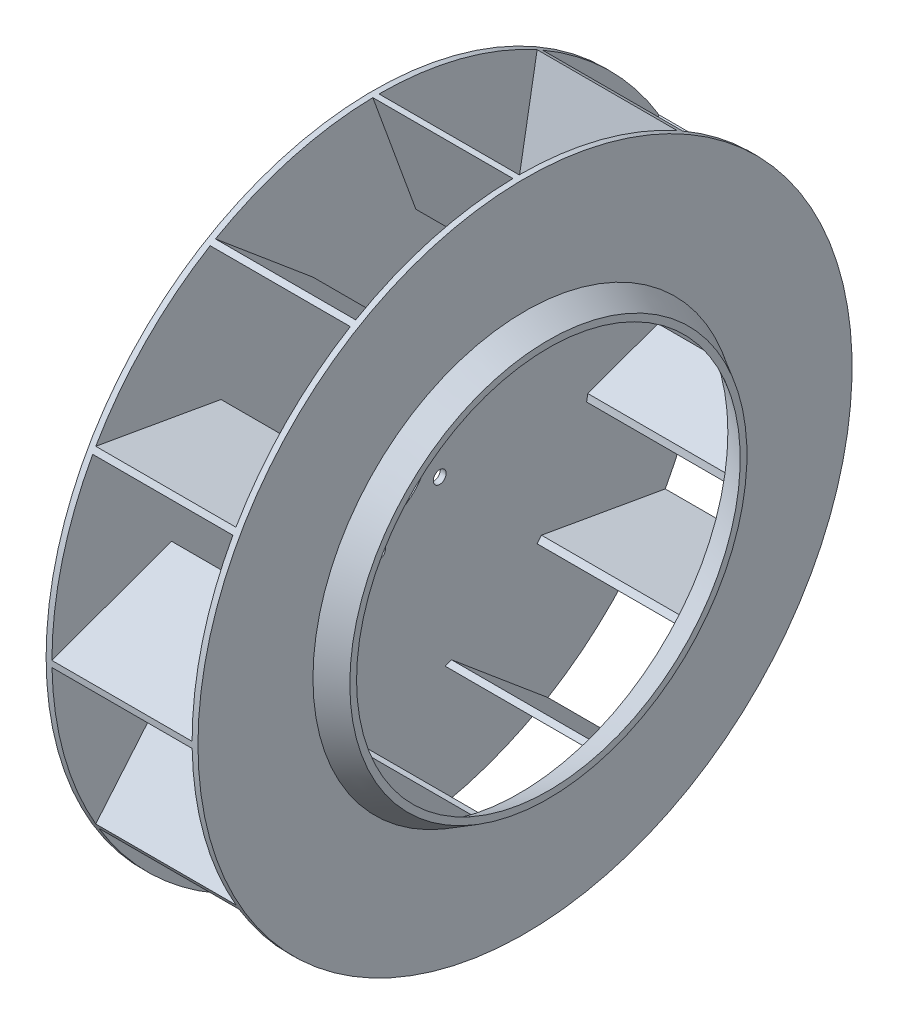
ISO-10303-21;
HEADER;
FILE_DESCRIPTION(('STEP AP214'),'2;1');
FILE_NAME('part.step','',(''),(''),'','','');
FILE_SCHEMA(('AUTOMOTIVE_DESIGN { 1 0 10303 214 1 1 1 1 }'));
ENDSEC;
DATA;
#1=APPLICATION_CONTEXT('core data for automotive mechanical design processes');
#2=APPLICATION_PROTOCOL_DEFINITION('international standard','automotive_design',2000,#1);
#3=PRODUCT_CONTEXT('',#1,'mechanical');
#4=PRODUCT('Part','Part','',(#3));
#5=PRODUCT_RELATED_PRODUCT_CATEGORY('part','',(#4));
#6=PRODUCT_DEFINITION_FORMATION('','',#4);
#7=PRODUCT_DEFINITION_CONTEXT('part definition',#1,'design');
#8=PRODUCT_DEFINITION('design','',#6,#7);
#9=PRODUCT_DEFINITION_SHAPE('','',#8);
#10=(LENGTH_UNIT() NAMED_UNIT(*) SI_UNIT(.MILLI.,.METRE.));
#11=(NAMED_UNIT(*) PLANE_ANGLE_UNIT() SI_UNIT($,.RADIAN.));
#12=(NAMED_UNIT(*) SI_UNIT($,.STERADIAN.) SOLID_ANGLE_UNIT());
#13=UNCERTAINTY_MEASURE_WITH_UNIT(LENGTH_MEASURE(1.E-05),#10,'distance_accuracy_value','');
#14=(GEOMETRIC_REPRESENTATION_CONTEXT(3) GLOBAL_UNCERTAINTY_ASSIGNED_CONTEXT((#13)) GLOBAL_UNIT_ASSIGNED_CONTEXT((#10,
#11,#12)) REPRESENTATION_CONTEXT('',''));
#15=CARTESIAN_POINT('',(0.,0.,0.));
#16=DIRECTION('',(0.,0.,1.));
#17=DIRECTION('',(1.,0.,0.));
#18=AXIS2_PLACEMENT_3D('',#15,#16,#17);
#19=CARTESIAN_POINT('',(50.,280.,0.));
#20=DIRECTION('',(-1.,0.,0.));
#21=DIRECTION('',(0.,0.,1.));
#22=AXIS2_PLACEMENT_3D('',#19,#20,#21);
#23=PLANE('',#22);
#24=CARTESIAN_POINT('',(50.,0.,0.));
#25=DIRECTION('',(-1.,0.,0.));
#26=DIRECTION('',(0.,0.,1.));
#27=AXIS2_PLACEMENT_3D('',#24,#25,#26);
#28=CIRCLE('',#27,178.660254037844);
#29=CARTESIAN_POINT('',(50.,0.,178.660254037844));
#30=VERTEX_POINT('',#29);
#31=EDGE_CURVE('E11',#30,#30,#28,.T.);
#32=ORIENTED_EDGE('',*,*,#31,.F.);
#33=EDGE_LOOP('',(#32));
#34=FACE_BOUND('',#33,.T.);
#35=CARTESIAN_POINT('',(50.,0.,0.));
#36=DIRECTION('',(-1.,0.,0.));
#37=DIRECTION('',(0.,0.,1.));
#38=AXIS2_PLACEMENT_3D('',#35,#36,#37);
#39=CIRCLE('',#38,181.547005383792);
#40=CARTESIAN_POINT('',(50.,172.500712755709,56.5934560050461));
#41=VERTEX_POINT('',#40);
#42=CARTESIAN_POINT('',(50.,170.595275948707,62.1012639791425));
#43=VERTEX_POINT('',#42);
#44=EDGE_CURVE('E1346',#41,#43,#39,.F.);
#45=ORIENTED_EDGE('',*,*,#44,.F.);
#46=DIRECTION('',(0.,-0.642787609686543,-0.766044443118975));
#47=VECTOR('',#46,1.);
#48=CARTESIAN_POINT('',(50.,242.487113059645,139.999999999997));
#49=LINE('',#48,#47);
#50=CARTESIAN_POINT('',(50.,242.487113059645,139.999999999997));
#51=VERTEX_POINT('',#50);
#52=EDGE_CURVE('E345',#51,#41,#49,.T.);
#53=ORIENTED_EDGE('',*,*,#52,.F.);
#54=CARTESIAN_POINT('',(50.,0.,0.));
#55=DIRECTION('',(1.,0.,0.));
#56=DIRECTION('',(0.,1.,0.));
#57=AXIS2_PLACEMENT_3D('',#54,#55,#56);
#58=CIRCLE('',#57,280.);
#59=CARTESIAN_POINT('',(50.,279.949785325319,5.30261221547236));
#60=VERTEX_POINT('',#59);
#61=EDGE_CURVE('E420',#60,#51,#58,.T.);
#62=ORIENTED_EDGE('',*,*,#61,.F.);
#63=DIRECTION('',(0.,0.939692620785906,0.342020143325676));
#64=VECTOR('',#63,1.);
#65=CARTESIAN_POINT('',(50.,279.949785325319,5.30261221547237));
#66=LINE('',#65,#64);
#67=CARTESIAN_POINT('',(50.,178.790474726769,-31.5163657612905));
#68=VERTEX_POINT('',#67);
#69=EDGE_CURVE('E493',#68,#60,#66,.T.);
#70=ORIENTED_EDGE('',*,*,#69,.F.);
#71=CARTESIAN_POINT('',(50.,0.,0.));
#72=DIRECTION('',(-1.,0.,0.));
#73=DIRECTION('',(0.,0.,1.));
#74=AXIS2_PLACEMENT_3D('',#71,#72,#73);
#75=CIRCLE('',#74,181.547005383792);
#76=CARTESIAN_POINT('',(50.0000000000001,177.68672741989,-37.2389857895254));
#77=VERTEX_POINT('',#76);
#78=EDGE_CURVE('E497',#77,#68,#75,.F.);
#79=ORIENTED_EDGE('',*,*,#78,.F.);
#80=DIRECTION('',(0.,-0.939692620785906,-0.342020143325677));
#81=VECTOR('',#80,1.);
#82=CARTESIAN_POINT('',(50.,280.,0.));
#83=LINE('',#82,#81);
#84=CARTESIAN_POINT('',(50.,280.,0.));
#85=VERTEX_POINT('',#84);
#86=EDGE_CURVE('E503',#85,#77,#83,.T.);
#87=ORIENTED_EDGE('',*,*,#86,.F.);
#88=CARTESIAN_POINT('',(50.,245.094931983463,-135.382695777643));
#89=VERTEX_POINT('',#88);
#90=EDGE_CURVE('E426',#89,#85,#58,.T.);
#91=ORIENTED_EDGE('',*,*,#90,.F.);
#92=DIRECTION('',(0.,0.984807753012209,-0.173648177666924));
#93=VECTOR('',#92,1.);
#94=CARTESIAN_POINT('',(50.,245.094931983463,-135.382695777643));
#95=LINE('',#94,#93);
#96=CARTESIAN_POINT('',(50.,139.078910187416,-116.689210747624));
#97=VERTEX_POINT('',#96);
#98=EDGE_CURVE('E367',#97,#89,#95,.T.);
#99=ORIENTED_EDGE('',*,*,#98,.F.);
#100=CARTESIAN_POINT('',(50.,0.,0.));
#101=DIRECTION('',(-1.,0.,0.));
#102=DIRECTION('',(0.,0.,1.));
#103=AXIS2_PLACEMENT_3D('',#100,#101,#102);
#104=CIRCLE('',#103,181.547005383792);
#105=CARTESIAN_POINT('',(50.,135.261726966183,-121.093271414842));
#106=VERTEX_POINT('',#105);
#107=EDGE_CURVE('E770',#106,#97,#104,.F.);
#108=ORIENTED_EDGE('',*,*,#107,.F.);
#109=DIRECTION('',(0.,-0.984807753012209,0.173648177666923));
#110=VECTOR('',#109,1.);
#111=CARTESIAN_POINT('',(50.,242.487113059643,-140.));
#112=LINE('',#111,#110);
#113=CARTESIAN_POINT('',(50.,242.487113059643,-140.));
#114=VERTEX_POINT('',#113);
#115=EDGE_CURVE('E773',#114,#106,#112,.T.);
#116=ORIENTED_EDGE('',*,*,#115,.F.);
#117=CARTESIAN_POINT('',(50.,144.567089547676,-239.792319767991));
#118=VERTEX_POINT('',#117);
#119=EDGE_CURVE('E428',#118,#114,#58,.T.);
#120=ORIENTED_EDGE('',*,*,#119,.F.);
#121=DIRECTION('',(0.,0.766044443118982,-0.642787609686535));
#122=VECTOR('',#121,1.);
#123=CARTESIAN_POINT('',(50.,144.567089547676,-239.792319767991));
#124=LINE('',#123,#122);
#125=CARTESIAN_POINT('',(50.,62.1012639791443,-170.595275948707));
#126=VERTEX_POINT('',#125);
#127=EDGE_CURVE('E749',#126,#118,#124,.T.);
#128=ORIENTED_EDGE('',*,*,#127,.F.);
#129=CARTESIAN_POINT('',(50.,0.,0.));
#130=DIRECTION('',(-1.,0.,0.));
#131=DIRECTION('',(0.,0.,1.));
#132=AXIS2_PLACEMENT_3D('',#129,#130,#131);
#133=CIRCLE('',#132,181.547005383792);
#134=CARTESIAN_POINT('',(50.,56.5934560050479,-172.500712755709));
#135=VERTEX_POINT('',#134);
#136=EDGE_CURVE('E746',#135,#126,#133,.F.);
#137=ORIENTED_EDGE('',*,*,#136,.F.);
#138=DIRECTION('',(0.,-0.766044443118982,0.642787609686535));
#139=VECTOR('',#138,1.);
#140=CARTESIAN_POINT('',(50.,139.999999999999,-242.487113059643));
#141=LINE('',#140,#139);
#142=CARTESIAN_POINT('',(50.,139.999999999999,-242.487113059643));
#143=VERTEX_POINT('',#142);
#144=EDGE_CURVE('E750',#143,#135,#141,.T.);
#145=ORIENTED_EDGE('',*,*,#144,.F.);
#146=CARTESIAN_POINT('',(50.,5.30261221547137,-279.949785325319));
#147=VERTEX_POINT('',#146);
#148=EDGE_CURVE('E430',#147,#143,#58,.T.);
#149=ORIENTED_EDGE('',*,*,#148,.F.);
#150=DIRECTION('',(0.,0.342020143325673,-0.939692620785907));
#151=VECTOR('',#150,1.);
#152=CARTESIAN_POINT('',(50.,5.3026122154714,-279.949785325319));
#153=LINE('',#152,#151);
#154=CARTESIAN_POINT('',(50.,-31.5163657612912,-178.790474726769));
#155=VERTEX_POINT('',#154);
#156=EDGE_CURVE('E725',#155,#147,#153,.T.);
#157=ORIENTED_EDGE('',*,*,#156,.F.);
#158=CARTESIAN_POINT('',(50.,0.,0.));
#159=DIRECTION('',(-1.,0.,0.));
#160=DIRECTION('',(0.,0.,1.));
#161=AXIS2_PLACEMENT_3D('',#158,#159,#160);
#162=CIRCLE('',#161,181.547005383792);
#163=CARTESIAN_POINT('',(50.0000000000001,-37.238985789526,-177.68672741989));
#164=VERTEX_POINT('',#163);
#165=EDGE_CURVE('E722',#164,#155,#162,.F.);
#166=ORIENTED_EDGE('',*,*,#165,.F.);
#167=DIRECTION('',(0.,-0.342020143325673,0.939692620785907));
#168=VECTOR('',#167,1.);
#169=CARTESIAN_POINT('',(50.,-9.77615341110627E-13,-280.));
#170=LINE('',#169,#168);
#171=CARTESIAN_POINT('',(50.,-9.87194233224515E-13,-280.));
#172=VERTEX_POINT('',#171);
#173=EDGE_CURVE('E726',#172,#164,#170,.T.);
#174=ORIENTED_EDGE('',*,*,#173,.F.);
#175=CARTESIAN_POINT('',(50.0000000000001,-135.382695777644,-245.094931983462));
#176=VERTEX_POINT('',#175);
#177=EDGE_CURVE('E432',#176,#172,#58,.T.);
#178=ORIENTED_EDGE('',*,*,#177,.F.);
#179=DIRECTION('',(0.,-0.173648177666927,-0.984807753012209));
#180=VECTOR('',#179,1.);
#181=CARTESIAN_POINT('',(50.,-135.382695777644,-245.094931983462));
#182=LINE('',#181,#180);
#183=CARTESIAN_POINT('',(50.,-116.689210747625,-139.078910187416));
#184=VERTEX_POINT('',#183);
#185=EDGE_CURVE('E701',#184,#176,#182,.T.);
#186=ORIENTED_EDGE('',*,*,#185,.F.);
#187=CARTESIAN_POINT('',(50.,0.,0.));
#188=DIRECTION('',(-1.,0.,0.));
#189=DIRECTION('',(0.,0.,1.));
#190=AXIS2_PLACEMENT_3D('',#187,#188,#189);
#191=CIRCLE('',#190,181.547005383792);
#192=CARTESIAN_POINT('',(50.,-121.093271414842,-135.261726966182));
#193=VERTEX_POINT('',#192);
#194=EDGE_CURVE('E698',#193,#184,#191,.F.);
#195=ORIENTED_EDGE('',*,*,#194,.F.);
#196=DIRECTION('',(0.,0.173648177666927,0.984807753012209));
#197=VECTOR('',#196,1.);
#198=CARTESIAN_POINT('',(50.,-140.000000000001,-242.487113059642));
#199=LINE('',#198,#197);
#200=CARTESIAN_POINT('',(50.,-140.000000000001,-242.487113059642));
#201=VERTEX_POINT('',#200);
#202=EDGE_CURVE('E702',#201,#193,#199,.T.);
#203=ORIENTED_EDGE('',*,*,#202,.F.);
#204=CARTESIAN_POINT('',(50.0000000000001,-239.792319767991,-144.567089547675));
#205=VERTEX_POINT('',#204);
#206=EDGE_CURVE('E434',#205,#201,#58,.T.);
#207=ORIENTED_EDGE('',*,*,#206,.F.);
#208=DIRECTION('',(0.,-0.642787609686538,-0.766044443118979));
#209=VECTOR('',#208,1.);
#210=CARTESIAN_POINT('',(50.,-239.792319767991,-144.567089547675));
#211=LINE('',#210,#209);
#212=CARTESIAN_POINT('',(50.,-170.595275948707,-62.1012639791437));
#213=VERTEX_POINT('',#212);
#214=EDGE_CURVE('E677',#213,#205,#211,.T.);
#215=ORIENTED_EDGE('',*,*,#214,.F.);
#216=CARTESIAN_POINT('',(50.,0.,0.));
#217=DIRECTION('',(-1.,0.,0.));
#218=DIRECTION('',(0.,0.,1.));
#219=AXIS2_PLACEMENT_3D('',#216,#217,#218);
#220=CIRCLE('',#219,181.547005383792);
#221=CARTESIAN_POINT('',(50.,-172.500712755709,-56.5934560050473));
#222=VERTEX_POINT('',#221);
#223=EDGE_CURVE('E674',#222,#213,#220,.F.);
#224=ORIENTED_EDGE('',*,*,#223,.F.);
#225=DIRECTION('',(0.,0.642787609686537,0.76604444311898));
#226=VECTOR('',#225,1.);
#227=CARTESIAN_POINT('',(50.,-242.487113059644,-139.999999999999));
#228=LINE('',#227,#226);
#229=CARTESIAN_POINT('',(50.,-242.487113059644,-139.999999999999));
#230=VERTEX_POINT('',#229);
#231=EDGE_CURVE('E678',#230,#222,#228,.T.);
#232=ORIENTED_EDGE('',*,*,#231,.F.);
#233=CARTESIAN_POINT('',(50.0000000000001,-279.949785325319,-5.30261221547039));
#234=VERTEX_POINT('',#233);
#235=EDGE_CURVE('E436',#234,#230,#58,.T.);
#236=ORIENTED_EDGE('',*,*,#235,.F.);
#237=DIRECTION('',(0.,-0.939692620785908,-0.34202014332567));
#238=VECTOR('',#237,1.);
#239=CARTESIAN_POINT('',(50.,-279.949785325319,-5.30261221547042));
#240=LINE('',#239,#238);
#241=CARTESIAN_POINT('',(50.,-178.790474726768,31.5163657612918));
#242=VERTEX_POINT('',#241);
#243=EDGE_CURVE('E653',#242,#234,#240,.T.);
#244=ORIENTED_EDGE('',*,*,#243,.F.);
#245=CARTESIAN_POINT('',(50.,0.,0.));
#246=DIRECTION('',(-1.,0.,0.));
#247=DIRECTION('',(0.,0.,1.));
#248=AXIS2_PLACEMENT_3D('',#245,#246,#247);
#249=CIRCLE('',#248,181.547005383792);
#250=CARTESIAN_POINT('',(50.,-177.68672741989,37.2389857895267));
#251=VERTEX_POINT('',#250);
#252=EDGE_CURVE('E650',#251,#242,#249,.F.);
#253=ORIENTED_EDGE('',*,*,#252,.F.);
#254=DIRECTION('',(0.,0.939692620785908,0.34202014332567));
#255=VECTOR('',#254,1.);
#256=CARTESIAN_POINT('',(50.,-280.,1.95523068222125E-12));
#257=LINE('',#256,#255);
#258=CARTESIAN_POINT('',(50.,-280.,1.96480957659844E-12));
#259=VERTEX_POINT('',#258);
#260=EDGE_CURVE('E654',#259,#251,#257,.T.);
#261=ORIENTED_EDGE('',*,*,#260,.F.);
#262=CARTESIAN_POINT('',(50.0000000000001,-245.094931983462,135.382695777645));
#263=VERTEX_POINT('',#262);
#264=EDGE_CURVE('E438',#263,#259,#58,.T.);
#265=ORIENTED_EDGE('',*,*,#264,.F.);
#266=DIRECTION('',(0.,-0.984807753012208,0.17364817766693));
#267=VECTOR('',#266,1.);
#268=CARTESIAN_POINT('',(50.,-245.094931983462,135.382695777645));
#269=LINE('',#268,#267);
#270=CARTESIAN_POINT('',(50.,-139.078910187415,116.689210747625));
#271=VERTEX_POINT('',#270);
#272=EDGE_CURVE('E629',#271,#263,#269,.T.);
#273=ORIENTED_EDGE('',*,*,#272,.F.);
#274=CARTESIAN_POINT('',(50.,0.,0.));
#275=DIRECTION('',(-1.,0.,0.));
#276=DIRECTION('',(0.,0.,1.));
#277=AXIS2_PLACEMENT_3D('',#274,#275,#276);
#278=CIRCLE('',#277,181.547005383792);
#279=CARTESIAN_POINT('',(50.0000000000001,-135.261726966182,121.093271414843));
#280=VERTEX_POINT('',#279);
#281=EDGE_CURVE('E626',#280,#271,#278,.F.);
#282=ORIENTED_EDGE('',*,*,#281,.F.);
#283=DIRECTION('',(0.,0.984807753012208,-0.17364817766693));
#284=VECTOR('',#283,1.);
#285=CARTESIAN_POINT('',(50.,-242.487113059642,140.000000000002));
#286=LINE('',#285,#284);
#287=CARTESIAN_POINT('',(50.,-242.487113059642,140.000000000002));
#288=VERTEX_POINT('',#287);
#289=EDGE_CURVE('E630',#288,#280,#286,.T.);
#290=ORIENTED_EDGE('',*,*,#289,.F.);
#291=CARTESIAN_POINT('',(50.0000000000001,-144.567089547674,239.792319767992));
#292=VERTEX_POINT('',#291);
#293=EDGE_CURVE('E416',#292,#288,#58,.T.);
#294=ORIENTED_EDGE('',*,*,#293,.F.);
#295=DIRECTION('',(0.,-0.766044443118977,0.64278760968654));
#296=VECTOR('',#295,1.);
#297=CARTESIAN_POINT('',(50.,-144.567089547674,239.792319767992));
#298=LINE('',#297,#296);
#299=CARTESIAN_POINT('',(50.,-62.1012639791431,170.595275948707));
#300=VERTEX_POINT('',#299);
#301=EDGE_CURVE('E606',#300,#292,#298,.T.);
#302=ORIENTED_EDGE('',*,*,#301,.F.);
#303=CARTESIAN_POINT('',(50.,0.,0.));
#304=DIRECTION('',(-1.,0.,0.));
#305=DIRECTION('',(0.,0.,1.));
#306=AXIS2_PLACEMENT_3D('',#303,#304,#305);
#307=CIRCLE('',#306,181.547005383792);
#308=CARTESIAN_POINT('',(50.,-56.5934560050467,172.500712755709));
#309=VERTEX_POINT('',#308);
#310=EDGE_CURVE('E603',#309,#300,#307,.F.);
#311=ORIENTED_EDGE('',*,*,#310,.F.);
#312=DIRECTION('',(0.,0.766044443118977,-0.64278760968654));
#313=VECTOR('',#312,1.);
#314=CARTESIAN_POINT('',(50.,-139.999999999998,242.487113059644));
#315=LINE('',#314,#313);
#316=CARTESIAN_POINT('',(50.,-139.999999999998,242.487113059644));
#317=VERTEX_POINT('',#316);
#318=EDGE_CURVE('E607',#317,#309,#315,.T.);
#319=ORIENTED_EDGE('',*,*,#318,.F.);
#320=CARTESIAN_POINT('',(50.,-5.30261221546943,279.949785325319));
#321=VERTEX_POINT('',#320);
#322=EDGE_CURVE('E415',#321,#317,#58,.T.);
#323=ORIENTED_EDGE('',*,*,#322,.F.);
#324=DIRECTION('',(0.,-0.342020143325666,0.939692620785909));
#325=VECTOR('',#324,1.);
#326=CARTESIAN_POINT('',(50.,-5.30261221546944,279.949785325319));
#327=LINE('',#326,#325);
#328=CARTESIAN_POINT('',(50.,31.5163657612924,178.790474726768));
#329=VERTEX_POINT('',#328);
#330=EDGE_CURVE('E587',#329,#321,#327,.T.);
#331=ORIENTED_EDGE('',*,*,#330,.F.);
#332=CARTESIAN_POINT('',(50.,0.,0.));
#333=DIRECTION('',(-1.,0.,0.));
#334=DIRECTION('',(0.,0.,1.));
#335=AXIS2_PLACEMENT_3D('',#332,#333,#334);
#336=CIRCLE('',#335,181.547005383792);
#337=CARTESIAN_POINT('',(50.,37.2389857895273,177.68672741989));
#338=VERTEX_POINT('',#337);
#339=EDGE_CURVE('E602',#338,#329,#336,.F.);
#340=ORIENTED_EDGE('',*,*,#339,.F.);
#341=DIRECTION('',(0.,0.342020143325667,-0.939692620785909));
#342=VECTOR('',#341,1.);
#343=CARTESIAN_POINT('',(50.,2.93284602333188E-12,280.));
#344=LINE('',#343,#342);
#345=CARTESIAN_POINT('',(50.,2.94242491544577E-12,280.));
#346=VERTEX_POINT('',#345);
#347=EDGE_CURVE('E599',#346,#338,#344,.T.);
#348=ORIENTED_EDGE('',*,*,#347,.F.);
#349=CARTESIAN_POINT('',(50.,135.382695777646,245.094931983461));
#350=VERTEX_POINT('',#349);
#351=EDGE_CURVE('E369',#350,#346,#58,.T.);
#352=ORIENTED_EDGE('',*,*,#351,.F.);
#353=DIRECTION('',(0.,0.173648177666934,0.984807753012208));
#354=VECTOR('',#353,1.);
#355=CARTESIAN_POINT('',(50.,135.382695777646,245.094931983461));
#356=LINE('',#355,#354);
#357=CARTESIAN_POINT('',(50.,116.689210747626,139.078910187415));
#358=VERTEX_POINT('',#357);
#359=EDGE_CURVE('E580',#358,#350,#356,.T.);
#360=ORIENTED_EDGE('',*,*,#359,.F.);
#361=CARTESIAN_POINT('',(50.,0.,0.));
#362=DIRECTION('',(-1.,0.,0.));
#363=DIRECTION('',(0.,0.,1.));
#364=AXIS2_PLACEMENT_3D('',#361,#362,#363);
#365=CIRCLE('',#364,181.547005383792);
#366=CARTESIAN_POINT('',(50.0000000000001,121.093271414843,135.261726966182));
#367=VERTEX_POINT('',#366);
#368=EDGE_CURVE('E584',#367,#358,#365,.F.);
#369=ORIENTED_EDGE('',*,*,#368,.F.);
#370=DIRECTION('',(0.,-0.173648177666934,-0.984807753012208));
#371=VECTOR('',#370,1.);
#372=CARTESIAN_POINT('',(50.,140.000000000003,242.487113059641));
#373=LINE('',#372,#371);
#374=CARTESIAN_POINT('',(50.,140.000000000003,242.487113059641));
#375=VERTEX_POINT('',#374);
#376=EDGE_CURVE('E1361',#375,#367,#373,.T.);
#377=ORIENTED_EDGE('',*,*,#376,.F.);
#378=CARTESIAN_POINT('',(50.,239.792319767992,144.567089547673));
#379=VERTEX_POINT('',#378);
#380=EDGE_CURVE('E371',#379,#375,#58,.T.);
#381=ORIENTED_EDGE('',*,*,#380,.F.);
#382=DIRECTION('',(0.,0.642787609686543,0.766044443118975));
#383=VECTOR('',#382,1.);
#384=CARTESIAN_POINT('',(50.,239.792319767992,144.567089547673));
#385=LINE('',#384,#383);
#386=EDGE_CURVE('E57',#43,#379,#385,.T.);
#387=ORIENTED_EDGE('',*,*,#386,.F.);
#388=EDGE_LOOP('',(#45,#53,#62,#70,#79,#87,#91,#99,#108,#116,#120,#128,#137,#145,#149,#157,#166,
#174,#178,#186,#195,#203,#207,#215,#224,#232,#236,#244,#253,#261,#265,#273,#282,#290,#294,#302,
#311,#319,#323,#331,#340,#348,#352,#360,#369,#377,#381,#387));
#389=FACE_BOUND('',#388,.T.);
#390=ADVANCED_FACE('F31',(#34,#389),#23,.T.);
#391=CARTESIAN_POINT('',(-70.,280.,0.));
#392=DIRECTION('',(1.,0.,0.));
#393=DIRECTION('',(0.,0.,-1.));
#394=AXIS2_PLACEMENT_3D('',#391,#392,#393);
#395=PLANE('',#394);
#396=CARTESIAN_POINT('',(-70.,30.0000000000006,-51.961524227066));
#397=DIRECTION('',(1.,0.,0.));
#398=DIRECTION('',(0.,0.,-1.));
#399=AXIS2_PLACEMENT_3D('',#396,#397,#398);
#400=CIRCLE('',#399,5.50000000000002);
#401=CARTESIAN_POINT('',(-70.,30.0000000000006,-57.461524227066));
#402=VERTEX_POINT('',#401);
#403=EDGE_CURVE('E1307',#402,#402,#400,.T.);
#404=ORIENTED_EDGE('',*,*,#403,.F.);
#405=EDGE_LOOP('',(#404));
#406=FACE_BOUND('',#405,.T.);
#407=CARTESIAN_POINT('',(-70.,-29.9999999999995,-51.9615242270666));
#408=DIRECTION('',(1.,0.,0.));
#409=DIRECTION('',(0.,0.,-1.));
#410=AXIS2_PLACEMENT_3D('',#407,#408,#409);
#411=CIRCLE('',#410,5.50000000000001);
#412=CARTESIAN_POINT('',(-70.,-29.9999999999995,-57.4615242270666));
#413=VERTEX_POINT('',#412);
#414=EDGE_CURVE('E1309',#413,#413,#411,.T.);
#415=ORIENTED_EDGE('',*,*,#414,.F.);
#416=EDGE_LOOP('',(#415));
#417=FACE_BOUND('',#416,.T.);
#418=CARTESIAN_POINT('',(-70.,-60.,-4.18978003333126E-13));
#419=DIRECTION('',(1.,0.,0.));
#420=DIRECTION('',(0.,0.,-1.));
#421=AXIS2_PLACEMENT_3D('',#418,#419,#420);
#422=CIRCLE('',#421,5.50000000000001);
#423=CARTESIAN_POINT('',(-70.,-60.,-5.50000000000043));
#424=VERTEX_POINT('',#423);
#425=EDGE_CURVE('E1317',#424,#424,#422,.T.);
#426=ORIENTED_EDGE('',*,*,#425,.F.);
#427=EDGE_LOOP('',(#426));
#428=FACE_BOUND('',#427,.T.);
#429=CARTESIAN_POINT('',(-70.,-30.0000000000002,51.9615242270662));
#430=DIRECTION('',(1.,0.,0.));
#431=DIRECTION('',(0.,0.,-1.));
#432=AXIS2_PLACEMENT_3D('',#429,#430,#431);
#433=CIRCLE('',#432,5.50000000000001);
#434=CARTESIAN_POINT('',(-70.,-30.0000000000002,46.4615242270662));
#435=VERTEX_POINT('',#434);
#436=EDGE_CURVE('E1323',#435,#435,#433,.T.);
#437=ORIENTED_EDGE('',*,*,#436,.F.);
#438=EDGE_LOOP('',(#437));
#439=FACE_BOUND('',#438,.T.);
#440=CARTESIAN_POINT('',(-70.,29.9999999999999,51.9615242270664));
#441=DIRECTION('',(1.,0.,0.));
#442=DIRECTION('',(0.,0.,-1.));
#443=AXIS2_PLACEMENT_3D('',#440,#441,#442);
#444=CIRCLE('',#443,5.50000000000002);
#445=CARTESIAN_POINT('',(-70.,29.9999999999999,46.4615242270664));
#446=VERTEX_POINT('',#445);
#447=EDGE_CURVE('E1329',#446,#446,#444,.T.);
#448=ORIENTED_EDGE('',*,*,#447,.F.);
#449=EDGE_LOOP('',(#448));
#450=FACE_BOUND('',#449,.T.);
#451=CARTESIAN_POINT('',(-70.,60.,0.));
#452=DIRECTION('',(1.,0.,0.));
#453=DIRECTION('',(0.,0.,-1.));
#454=AXIS2_PLACEMENT_3D('',#451,#452,#453);
#455=CIRCLE('',#454,5.50000000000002);
#456=CARTESIAN_POINT('',(-70.,60.,-5.50000000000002));
#457=VERTEX_POINT('',#456);
#458=EDGE_CURVE('E1335',#457,#457,#455,.T.);
#459=ORIENTED_EDGE('',*,*,#458,.F.);
#460=EDGE_LOOP('',(#459));
#461=FACE_BOUND('',#460,.T.);
#462=CARTESIAN_POINT('',(-70.,0.,0.));
#463=DIRECTION('',(1.,0.,0.));
#464=DIRECTION('',(0.,0.,-1.));
#465=AXIS2_PLACEMENT_3D('',#462,#463,#464);
#466=CIRCLE('',#465,42.5);
#467=CARTESIAN_POINT('',(-70.,0.,-42.5));
#468=VERTEX_POINT('',#467);
#469=EDGE_CURVE('E1341',#468,#468,#466,.T.);
#470=ORIENTED_EDGE('',*,*,#469,.F.);
#471=EDGE_LOOP('',(#470));
#472=FACE_BOUND('',#471,.T.);
#473=CARTESIAN_POINT('',(-70.,0.,0.));
#474=DIRECTION('',(-1.,0.,0.));
#475=DIRECTION('',(0.,-1.,0.));
#476=AXIS2_PLACEMENT_3D('',#473,#474,#475);
#477=CIRCLE('',#476,280.);
#478=CARTESIAN_POINT('',(-70.,242.487113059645,139.999999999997));
#479=VERTEX_POINT('',#478);
#480=CARTESIAN_POINT('',(-70.,279.949785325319,5.30261221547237));
#481=VERTEX_POINT('',#480);
#482=EDGE_CURVE('E35',#479,#481,#477,.T.);
#483=ORIENTED_EDGE('',*,*,#482,.F.);
#484=DIRECTION('',(0.,0.642787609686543,0.766044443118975));
#485=VECTOR('',#484,1.);
#486=CARTESIAN_POINT('',(-70.,242.487113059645,139.999999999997));
#487=LINE('',#486,#485);
#488=CARTESIAN_POINT('',(-70.,172.500712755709,56.5934560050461));
#489=VERTEX_POINT('',#488);
#490=EDGE_CURVE('E49',#489,#479,#487,.T.);
#491=ORIENTED_EDGE('',*,*,#490,.F.);
#492=CARTESIAN_POINT('',(-70.,0.,0.));
#493=DIRECTION('',(-1.,0.,0.));
#494=DIRECTION('',(0.,0.499999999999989,-0.866025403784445));
#495=AXIS2_PLACEMENT_3D('',#492,#493,#494);
#496=CIRCLE('',#495,181.547005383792);
#497=CARTESIAN_POINT('',(-70.,170.595275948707,62.1012639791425));
#498=VERTEX_POINT('',#497);
#499=EDGE_CURVE('E355',#498,#489,#496,.T.);
#500=ORIENTED_EDGE('',*,*,#499,.F.);
#501=DIRECTION('',(0.,-0.642787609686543,-0.766044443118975));
#502=VECTOR('',#501,1.);
#503=CARTESIAN_POINT('',(-70.,239.792319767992,144.567089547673));
#504=LINE('',#503,#502);
#505=CARTESIAN_POINT('',(-70.,239.792319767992,144.567089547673));
#506=VERTEX_POINT('',#505);
#507=EDGE_CURVE('E340',#506,#498,#504,.T.);
#508=ORIENTED_EDGE('',*,*,#507,.F.);
#509=CARTESIAN_POINT('',(-70.,140.000000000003,242.487113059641));
#510=VERTEX_POINT('',#509);
#511=EDGE_CURVE('E353',#510,#506,#477,.T.);
#512=ORIENTED_EDGE('',*,*,#511,.F.);
#513=DIRECTION('',(0.,0.173648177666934,0.984807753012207));
#514=VECTOR('',#513,1.);
#515=CARTESIAN_POINT('',(-70.,140.000000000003,242.487113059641));
#516=LINE('',#515,#514);
#517=CARTESIAN_POINT('',(-70.,121.093271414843,135.261726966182));
#518=VERTEX_POINT('',#517);
#519=EDGE_CURVE('E1368',#518,#510,#516,.T.);
#520=ORIENTED_EDGE('',*,*,#519,.F.);
#521=CARTESIAN_POINT('',(-70.,0.,0.));
#522=DIRECTION('',(-1.,0.,0.));
#523=DIRECTION('',(0.,0.866025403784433,-0.50000000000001));
#524=AXIS2_PLACEMENT_3D('',#521,#522,#523);
#525=CIRCLE('',#524,181.547005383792);
#526=CARTESIAN_POINT('',(-70.,116.689210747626,139.078910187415));
#527=VERTEX_POINT('',#526);
#528=EDGE_CURVE('E1365',#527,#518,#525,.T.);
#529=ORIENTED_EDGE('',*,*,#528,.F.);
#530=DIRECTION('',(0.,-0.173648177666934,-0.984807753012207));
#531=VECTOR('',#530,1.);
#532=CARTESIAN_POINT('',(-70.,135.382695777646,245.094931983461));
#533=LINE('',#532,#531);
#534=CARTESIAN_POINT('',(-70.,135.382695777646,245.094931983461));
#535=VERTEX_POINT('',#534);
#536=EDGE_CURVE('E1349',#535,#527,#533,.T.);
#537=ORIENTED_EDGE('',*,*,#536,.F.);
#538=CARTESIAN_POINT('',(-70.,2.94209101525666E-12,280.));
#539=VERTEX_POINT('',#538);
#540=EDGE_CURVE('E362',#539,#535,#477,.T.);
#541=ORIENTED_EDGE('',*,*,#540,.F.);
#542=DIRECTION('',(0.,-0.342020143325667,0.939692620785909));
#543=VECTOR('',#542,1.);
#544=CARTESIAN_POINT('',(-70.,2.93284602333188E-12,280.));
#545=LINE('',#544,#543);
#546=CARTESIAN_POINT('',(-70.,37.2389857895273,177.68672741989));
#547=VERTEX_POINT('',#546);
#548=EDGE_CURVE('E582',#547,#539,#545,.T.);
#549=ORIENTED_EDGE('',*,*,#548,.F.);
#550=CARTESIAN_POINT('',(-70.,0.,0.));
#551=DIRECTION('',(-1.,0.,0.));
#552=DIRECTION('',(0.,1.,0.));
#553=AXIS2_PLACEMENT_3D('',#550,#551,#552);
#554=CIRCLE('',#553,181.547005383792);
#555=CARTESIAN_POINT('',(-70.,31.5163657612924,178.790474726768));
#556=VERTEX_POINT('',#555);
#557=EDGE_CURVE('E578',#556,#547,#554,.T.);
#558=ORIENTED_EDGE('',*,*,#557,.F.);
#559=DIRECTION('',(0.,0.342020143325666,-0.939692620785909));
#560=VECTOR('',#559,1.);
#561=CARTESIAN_POINT('',(-70.,-5.30261221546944,279.949785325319));
#562=LINE('',#561,#560);
#563=CARTESIAN_POINT('',(-70.,-5.30261221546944,279.949785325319));
#564=VERTEX_POINT('',#563);
#565=EDGE_CURVE('E575',#564,#556,#562,.T.);
#566=ORIENTED_EDGE('',*,*,#565,.F.);
#567=CARTESIAN_POINT('',(-69.9999999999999,-139.999999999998,242.487113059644));
#568=VERTEX_POINT('',#567);
#569=EDGE_CURVE('E365',#568,#564,#477,.T.);
#570=ORIENTED_EDGE('',*,*,#569,.F.);
#571=DIRECTION('',(0.,-0.766044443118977,0.64278760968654));
#572=VECTOR('',#571,1.);
#573=CARTESIAN_POINT('',(-70.,-139.999999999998,242.487113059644));
#574=LINE('',#573,#572);
#575=CARTESIAN_POINT('',(-70.,-56.5934560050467,172.500712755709));
#576=VERTEX_POINT('',#575);
#577=EDGE_CURVE('E572',#576,#568,#574,.T.);
#578=ORIENTED_EDGE('',*,*,#577,.F.);
#579=CARTESIAN_POINT('',(-70.,0.,0.));
#580=DIRECTION('',(-1.,0.,0.));
#581=DIRECTION('',(0.,0.866025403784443,0.499999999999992));
#582=AXIS2_PLACEMENT_3D('',#579,#580,#581);
#583=CIRCLE('',#582,181.547005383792);
#584=CARTESIAN_POINT('',(-70.,-62.1012639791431,170.595275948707));
#585=VERTEX_POINT('',#584);
#586=EDGE_CURVE('E613',#585,#576,#583,.T.);
#587=ORIENTED_EDGE('',*,*,#586,.F.);
#588=DIRECTION('',(0.,0.766044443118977,-0.64278760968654));
#589=VECTOR('',#588,1.);
#590=CARTESIAN_POINT('',(-70.,-144.567089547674,239.792319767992));
#591=LINE('',#590,#589);
#592=CARTESIAN_POINT('',(-70.,-144.567089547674,239.792319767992));
#593=VERTEX_POINT('',#592);
#594=EDGE_CURVE('E610',#593,#585,#591,.T.);
#595=ORIENTED_EDGE('',*,*,#594,.F.);
#596=CARTESIAN_POINT('',(-69.9999999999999,-242.487113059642,140.000000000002));
#597=VERTEX_POINT('',#596);
#598=EDGE_CURVE('E410',#597,#593,#477,.T.);
#599=ORIENTED_EDGE('',*,*,#598,.F.);
#600=DIRECTION('',(0.,-0.984807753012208,0.17364817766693));
#601=VECTOR('',#600,1.);
#602=CARTESIAN_POINT('',(-70.,-242.487113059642,140.000000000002));
#603=LINE('',#602,#601);
#604=CARTESIAN_POINT('',(-70.,-135.261726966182,121.093271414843));
#605=VERTEX_POINT('',#604);
#606=EDGE_CURVE('E638',#605,#597,#603,.T.);
#607=ORIENTED_EDGE('',*,*,#606,.F.);
#608=CARTESIAN_POINT('',(-70.,0.,0.));
#609=DIRECTION('',(-1.,0.,0.));
#610=DIRECTION('',(0.,0.500000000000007,0.866025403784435));
#611=AXIS2_PLACEMENT_3D('',#608,#609,#610);
#612=CIRCLE('',#611,181.547005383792);
#613=CARTESIAN_POINT('',(-70.,-139.078910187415,116.689210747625));
#614=VERTEX_POINT('',#613);
#615=EDGE_CURVE('E635',#614,#605,#612,.T.);
#616=ORIENTED_EDGE('',*,*,#615,.F.);
#617=DIRECTION('',(0.,0.984807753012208,-0.17364817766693));
#618=VECTOR('',#617,1.);
#619=CARTESIAN_POINT('',(-70.,-245.094931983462,135.382695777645));
#620=LINE('',#619,#618);
#621=CARTESIAN_POINT('',(-70.,-245.094931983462,135.382695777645));
#622=VERTEX_POINT('',#621);
#623=EDGE_CURVE('E609',#622,#614,#620,.T.);
#624=ORIENTED_EDGE('',*,*,#623,.F.);
#625=CARTESIAN_POINT('',(-69.9999999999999,-280.,1.95676808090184E-12));
#626=VERTEX_POINT('',#625);
#627=EDGE_CURVE('E406',#626,#622,#477,.T.);
#628=ORIENTED_EDGE('',*,*,#627,.F.);
#629=DIRECTION('',(0.,-0.939692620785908,-0.34202014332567));
#630=VECTOR('',#629,1.);
#631=CARTESIAN_POINT('',(-70.,-280.,1.95523068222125E-12));
#632=LINE('',#631,#630);
#633=CARTESIAN_POINT('',(-70.,-177.68672741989,37.2389857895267));
#634=VERTEX_POINT('',#633);
#635=EDGE_CURVE('E662',#634,#626,#632,.T.);
#636=ORIENTED_EDGE('',*,*,#635,.F.);
#637=CARTESIAN_POINT('',(-70.,0.,0.));
#638=DIRECTION('',(-1.,0.,0.));
#639=DIRECTION('',(0.,0.,1.));
#640=AXIS2_PLACEMENT_3D('',#637,#638,#639);
#641=CIRCLE('',#640,181.547005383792);
#642=CARTESIAN_POINT('',(-70.,-178.790474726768,31.5163657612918));
#643=VERTEX_POINT('',#642);
#644=EDGE_CURVE('E659',#643,#634,#641,.T.);
#645=ORIENTED_EDGE('',*,*,#644,.F.);
#646=DIRECTION('',(0.,0.939692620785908,0.34202014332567));
#647=VECTOR('',#646,1.);
#648=CARTESIAN_POINT('',(-70.,-279.949785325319,-5.30261221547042));
#649=LINE('',#648,#647);
#650=CARTESIAN_POINT('',(-70.,-279.949785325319,-5.30261221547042));
#651=VERTEX_POINT('',#650);
#652=EDGE_CURVE('E632',#651,#643,#649,.T.);
#653=ORIENTED_EDGE('',*,*,#652,.F.);
#654=CARTESIAN_POINT('',(-69.9999999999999,-242.487113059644,-139.999999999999));
#655=VERTEX_POINT('',#654);
#656=EDGE_CURVE('E402',#655,#651,#477,.T.);
#657=ORIENTED_EDGE('',*,*,#656,.F.);
#658=DIRECTION('',(0.,-0.642787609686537,-0.76604444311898));
#659=VECTOR('',#658,1.);
#660=CARTESIAN_POINT('',(-70.,-242.487113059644,-139.999999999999));
#661=LINE('',#660,#659);
#662=CARTESIAN_POINT('',(-70.,-172.500712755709,-56.5934560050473));
#663=VERTEX_POINT('',#662);
#664=EDGE_CURVE('E686',#663,#655,#661,.T.);
#665=ORIENTED_EDGE('',*,*,#664,.F.);
#666=CARTESIAN_POINT('',(-70.,0.,0.));
#667=DIRECTION('',(-1.,0.,0.));
#668=DIRECTION('',(0.,-0.499999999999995,0.866025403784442));
#669=AXIS2_PLACEMENT_3D('',#666,#667,#668);
#670=CIRCLE('',#669,181.547005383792);
#671=CARTESIAN_POINT('',(-70.,-170.595275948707,-62.1012639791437));
#672=VERTEX_POINT('',#671);
#673=EDGE_CURVE('E683',#672,#663,#670,.T.);
#674=ORIENTED_EDGE('',*,*,#673,.F.);
#675=DIRECTION('',(0.,0.642787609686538,0.766044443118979));
#676=VECTOR('',#675,1.);
#677=CARTESIAN_POINT('',(-70.,-239.792319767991,-144.567089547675));
#678=LINE('',#677,#676);
#679=CARTESIAN_POINT('',(-70.,-239.792319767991,-144.567089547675));
#680=VERTEX_POINT('',#679);
#681=EDGE_CURVE('E656',#680,#672,#678,.T.);
#682=ORIENTED_EDGE('',*,*,#681,.F.);
#683=CARTESIAN_POINT('',(-69.9999999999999,-140.000000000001,-242.487113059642));
#684=VERTEX_POINT('',#683);
#685=EDGE_CURVE('E398',#684,#680,#477,.T.);
#686=ORIENTED_EDGE('',*,*,#685,.F.);
#687=DIRECTION('',(0.,-0.173648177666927,-0.984807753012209));
#688=VECTOR('',#687,1.);
#689=CARTESIAN_POINT('',(-70.,-140.000000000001,-242.487113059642));
#690=LINE('',#689,#688);
#691=CARTESIAN_POINT('',(-70.,-121.093271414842,-135.261726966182));
#692=VERTEX_POINT('',#691);
#693=EDGE_CURVE('E710',#692,#684,#690,.T.);
#694=ORIENTED_EDGE('',*,*,#693,.F.);
#695=CARTESIAN_POINT('',(-70.,0.,0.));
#696=DIRECTION('',(-1.,0.,0.));
#697=DIRECTION('',(0.,-0.866025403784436,0.500000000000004));
#698=AXIS2_PLACEMENT_3D('',#695,#696,#697);
#699=CIRCLE('',#698,181.547005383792);
#700=CARTESIAN_POINT('',(-70.,-116.689210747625,-139.078910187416));
#701=VERTEX_POINT('',#700);
#702=EDGE_CURVE('E707',#701,#692,#699,.T.);
#703=ORIENTED_EDGE('',*,*,#702,.F.);
#704=DIRECTION('',(0.,0.173648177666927,0.984807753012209));
#705=VECTOR('',#704,1.);
#706=CARTESIAN_POINT('',(-70.,-135.382695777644,-245.094931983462));
#707=LINE('',#706,#705);
#708=CARTESIAN_POINT('',(-70.,-135.382695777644,-245.094931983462));
#709=VERTEX_POINT('',#708);
#710=EDGE_CURVE('E680',#709,#701,#707,.T.);
#711=ORIENTED_EDGE('',*,*,#710,.F.);
#712=CARTESIAN_POINT('',(-70.,-9.71445146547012E-13,-280.));
#713=VERTEX_POINT('',#712);
#714=EDGE_CURVE('E394',#713,#709,#477,.T.);
#715=ORIENTED_EDGE('',*,*,#714,.F.);
#716=DIRECTION('',(0.,0.342020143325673,-0.939692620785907));
#717=VECTOR('',#716,1.);
#718=CARTESIAN_POINT('',(-70.,-9.77615341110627E-13,-280.));
#719=LINE('',#718,#717);
#720=CARTESIAN_POINT('',(-70.,-37.238985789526,-177.68672741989));
#721=VERTEX_POINT('',#720);
#722=EDGE_CURVE('E734',#721,#713,#719,.T.);
#723=ORIENTED_EDGE('',*,*,#722,.F.);
#724=CARTESIAN_POINT('',(-70.,0.,0.));
#725=DIRECTION('',(-1.,0.,0.));
#726=DIRECTION('',(0.,-1.,0.));
#727=AXIS2_PLACEMENT_3D('',#724,#725,#726);
#728=CIRCLE('',#727,181.547005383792);
#729=CARTESIAN_POINT('',(-70.,-31.5163657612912,-178.790474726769));
#730=VERTEX_POINT('',#729);
#731=EDGE_CURVE('E731',#730,#721,#728,.T.);
#732=ORIENTED_EDGE('',*,*,#731,.F.);
#733=DIRECTION('',(0.,-0.342020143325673,0.939692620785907));
#734=VECTOR('',#733,1.);
#735=CARTESIAN_POINT('',(-70.,5.3026122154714,-279.949785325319));
#736=LINE('',#735,#734);
#737=CARTESIAN_POINT('',(-70.,5.3026122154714,-279.949785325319));
#738=VERTEX_POINT('',#737);
#739=EDGE_CURVE('E704',#738,#730,#736,.T.);
#740=ORIENTED_EDGE('',*,*,#739,.F.);
#741=CARTESIAN_POINT('',(-70.,139.999999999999,-242.487113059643));
#742=VERTEX_POINT('',#741);
#743=EDGE_CURVE('E389',#742,#738,#477,.T.);
#744=ORIENTED_EDGE('',*,*,#743,.F.);
#745=DIRECTION('',(0.,0.766044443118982,-0.642787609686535));
#746=VECTOR('',#745,1.);
#747=CARTESIAN_POINT('',(-70.,139.999999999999,-242.487113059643));
#748=LINE('',#747,#746);
#749=CARTESIAN_POINT('',(-70.,56.5934560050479,-172.500712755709));
#750=VERTEX_POINT('',#749);
#751=EDGE_CURVE('E758',#750,#742,#748,.T.);
#752=ORIENTED_EDGE('',*,*,#751,.F.);
#753=CARTESIAN_POINT('',(-70.,0.,0.));
#754=DIRECTION('',(-1.,0.,0.));
#755=DIRECTION('',(0.,-0.86602540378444,-0.499999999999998));
#756=AXIS2_PLACEMENT_3D('',#753,#754,#755);
#757=CIRCLE('',#756,181.547005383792);
#758=CARTESIAN_POINT('',(-70.,62.1012639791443,-170.595275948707));
#759=VERTEX_POINT('',#758);
#760=EDGE_CURVE('E755',#759,#750,#757,.T.);
#761=ORIENTED_EDGE('',*,*,#760,.F.);
#762=DIRECTION('',(0.,-0.766044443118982,0.642787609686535));
#763=VECTOR('',#762,1.);
#764=CARTESIAN_POINT('',(-70.,144.567089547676,-239.792319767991));
#765=LINE('',#764,#763);
#766=CARTESIAN_POINT('',(-70.,144.567089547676,-239.792319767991));
#767=VERTEX_POINT('',#766);
#768=EDGE_CURVE('E728',#767,#759,#765,.T.);
#769=ORIENTED_EDGE('',*,*,#768,.F.);
#770=CARTESIAN_POINT('',(-70.,242.487113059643,-140.));
#771=VERTEX_POINT('',#770);
#772=EDGE_CURVE('E384',#771,#767,#477,.T.);
#773=ORIENTED_EDGE('',*,*,#772,.F.);
#774=DIRECTION('',(0.,0.984807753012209,-0.173648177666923));
#775=VECTOR('',#774,1.);
#776=CARTESIAN_POINT('',(-70.,242.487113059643,-140.));
#777=LINE('',#776,#775);
#778=CARTESIAN_POINT('',(-70.,135.261726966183,-121.093271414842));
#779=VERTEX_POINT('',#778);
#780=EDGE_CURVE('E780',#779,#771,#777,.T.);
#781=ORIENTED_EDGE('',*,*,#780,.F.);
#782=CARTESIAN_POINT('',(-70.,0.,0.));
#783=DIRECTION('',(-1.,0.,0.));
#784=DIRECTION('',(0.,-0.500000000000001,-0.866025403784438));
#785=AXIS2_PLACEMENT_3D('',#782,#783,#784);
#786=CIRCLE('',#785,181.547005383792);
#787=CARTESIAN_POINT('',(-70.,139.078910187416,-116.689210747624));
#788=VERTEX_POINT('',#787);
#789=EDGE_CURVE('E777',#788,#779,#786,.T.);
#790=ORIENTED_EDGE('',*,*,#789,.F.);
#791=DIRECTION('',(0.,-0.984807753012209,0.173648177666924));
#792=VECTOR('',#791,1.);
#793=CARTESIAN_POINT('',(-70.,245.094931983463,-135.382695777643));
#794=LINE('',#793,#792);
#795=CARTESIAN_POINT('',(-70.,245.094931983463,-135.382695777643));
#796=VERTEX_POINT('',#795);
#797=EDGE_CURVE('E752',#796,#788,#794,.T.);
#798=ORIENTED_EDGE('',*,*,#797,.F.);
#799=CARTESIAN_POINT('',(-70.,280.,0.));
#800=VERTEX_POINT('',#799);
#801=EDGE_CURVE('E377',#800,#796,#477,.T.);
#802=ORIENTED_EDGE('',*,*,#801,.F.);
#803=DIRECTION('',(0.,0.939692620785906,0.342020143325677));
#804=VECTOR('',#803,1.);
#805=CARTESIAN_POINT('',(-70.,280.,0.));
#806=LINE('',#805,#804);
#807=CARTESIAN_POINT('',(-70.,177.68672741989,-37.2389857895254));
#808=VERTEX_POINT('',#807);
#809=EDGE_CURVE('E516',#808,#800,#806,.T.);
#810=ORIENTED_EDGE('',*,*,#809,.F.);
#811=CARTESIAN_POINT('',(-70.,0.,0.));
#812=DIRECTION('',(-1.,0.,0.));
#813=DIRECTION('',(0.,0.,-1.));
#814=AXIS2_PLACEMENT_3D('',#811,#812,#813);
#815=CIRCLE('',#814,181.547005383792);
#816=CARTESIAN_POINT('',(-70.,178.790474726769,-31.5163657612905));
#817=VERTEX_POINT('',#816);
#818=EDGE_CURVE('E513',#817,#808,#815,.T.);
#819=ORIENTED_EDGE('',*,*,#818,.F.);
#820=DIRECTION('',(0.,-0.939692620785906,-0.342020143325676));
#821=VECTOR('',#820,1.);
#822=CARTESIAN_POINT('',(-70.,279.949785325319,5.30261221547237));
#823=LINE('',#822,#821);
#824=EDGE_CURVE('E509',#481,#817,#823,.T.);
#825=ORIENTED_EDGE('',*,*,#824,.F.);
#826=EDGE_LOOP('',(#483,#491,#500,#508,#512,#520,#529,#537,#541,#549,#558,#566,#570,#578,#587,
#595,#599,#607,#616,#624,#628,#636,#645,#653,#657,#665,#674,#682,#686,#694,#703,#711,#715,#723,
#732,#740,#744,#752,#761,#769,#773,#781,#790,#798,#802,#810,#819,#825));
#827=FACE_BOUND('',#826,.T.);
#828=ADVANCED_FACE('F351',(#406,#417,#428,#439,#450,#461,#472,#827),#395,.T.);
#829=CARTESIAN_POINT('',(75.,170.,0.));
#830=DIRECTION('',(-1.,0.,0.));
#831=DIRECTION('',(0.,0.,1.));
#832=AXIS2_PLACEMENT_3D('',#829,#830,#831);
#833=PLANE('',#832);
#834=CARTESIAN_POINT('',(75.,0.,0.));
#835=DIRECTION('',(-1.,0.,0.));
#836=DIRECTION('',(0.,0.,1.));
#837=AXIS2_PLACEMENT_3D('',#834,#835,#836);
#838=CIRCLE('',#837,164.226497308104);
#839=CARTESIAN_POINT('',(75.,0.,164.226497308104));
#840=VERTEX_POINT('',#839);
#841=EDGE_CURVE('E487',#840,#840,#838,.T.);
#842=ORIENTED_EDGE('',*,*,#841,.T.);
#843=EDGE_LOOP('',(#842));
#844=FACE_BOUND('',#843,.T.);
#845=CARTESIAN_POINT('',(75.,0.,0.));
#846=DIRECTION('',(-1.,0.,0.));
#847=DIRECTION('',(0.,0.,1.));
#848=AXIS2_PLACEMENT_3D('',#845,#846,#847);
#849=CIRCLE('',#848,170.);
#850=CARTESIAN_POINT('',(75.,0.,170.));
#851=VERTEX_POINT('',#850);
#852=EDGE_CURVE('E482',#851,#851,#849,.T.);
#853=ORIENTED_EDGE('',*,*,#852,.F.);
#854=EDGE_LOOP('',(#853));
#855=FACE_BOUND('',#854,.T.);
#856=ADVANCED_FACE('F818',(#844,#855),#833,.F.);
#857=CARTESIAN_POINT('',(75.,0.,0.));
#858=DIRECTION('',(-1.,0.,0.));
#859=DIRECTION('',(0.,0.,1.));
#860=AXIS2_PLACEMENT_3D('',#857,#858,#859);
#861=CONICAL_SURFACE('',#860,170.,0.523598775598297);
#862=CARTESIAN_POINT('',(55.,0.,0.));
#863=DIRECTION('',(-1.,0.,0.));
#864=DIRECTION('',(0.,0.,1.));
#865=AXIS2_PLACEMENT_3D('',#862,#863,#864);
#866=CIRCLE('',#865,181.547005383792);
#867=CARTESIAN_POINT('',(55.,0.,181.547005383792));
#868=VERTEX_POINT('',#867);
#869=EDGE_CURVE('E475',#868,#868,#866,.T.);
#870=ORIENTED_EDGE('',*,*,#869,.F.);
#871=EDGE_LOOP('',(#870));
#872=FACE_BOUND('',#871,.T.);
#873=ORIENTED_EDGE('',*,*,#852,.T.);
#874=EDGE_LOOP('',(#873));
#875=FACE_BOUND('',#874,.T.);
#876=ADVANCED_FACE('F813',(#872,#875),#861,.T.);
#877=CARTESIAN_POINT('',(55.,280.,0.));
#878=DIRECTION('',(-1.,0.,0.));
#879=DIRECTION('',(0.,0.,1.));
#880=AXIS2_PLACEMENT_3D('',#877,#878,#879);
#881=PLANE('',#880);
#882=CARTESIAN_POINT('',(55.,0.,0.));
#883=DIRECTION('',(-1.,0.,0.));
#884=DIRECTION('',(0.,0.,1.));
#885=AXIS2_PLACEMENT_3D('',#882,#883,#884);
#886=CIRCLE('',#885,280.);
#887=CARTESIAN_POINT('',(55.,0.,280.));
#888=VERTEX_POINT('',#887);
#889=EDGE_CURVE('E41',#888,#888,#886,.T.);
#890=ORIENTED_EDGE('',*,*,#889,.F.);
#891=EDGE_LOOP('',(#890));
#892=FACE_BOUND('',#891,.T.);
#893=ORIENTED_EDGE('',*,*,#869,.T.);
#894=EDGE_LOOP('',(#893));
#895=FACE_BOUND('',#894,.T.);
#896=ADVANCED_FACE('F806',(#892,#895),#881,.F.);
#897=CARTESIAN_POINT('',(-75.,0.,0.));
#898=DIRECTION('',(-1.,0.,0.));
#899=DIRECTION('',(0.,0.,1.));
#900=AXIS2_PLACEMENT_3D('',#897,#898,#899);
#901=CYLINDRICAL_SURFACE('',#900,280.);
#902=ORIENTED_EDGE('',*,*,#511,.T.);
#903=DIRECTION('',(-1.,0.,0.));
#904=VECTOR('',#903,1.);
#905=CARTESIAN_POINT('',(163.612483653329,239.792319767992,144.567089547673));
#906=LINE('',#905,#904);
#907=EDGE_CURVE('E337',#379,#506,#906,.T.);
#908=ORIENTED_EDGE('',*,*,#907,.F.);
#909=ORIENTED_EDGE('',*,*,#380,.T.);
#910=DIRECTION('',(-1.,0.,0.));
#911=VECTOR('',#910,1.);
#912=CARTESIAN_POINT('',(162.27967678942,140.000000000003,242.487113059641));
#913=LINE('',#912,#911);
#914=EDGE_CURVE('E361',#375,#510,#913,.T.);
#915=ORIENTED_EDGE('',*,*,#914,.T.);
#916=EDGE_LOOP('',(#902,#908,#909,#915));
#917=FACE_BOUND('',#916,.T.);
#918=ORIENTED_EDGE('',*,*,#540,.T.);
#919=DIRECTION('',(-1.,0.,0.));
#920=VECTOR('',#919,1.);
#921=CARTESIAN_POINT('',(162.27967678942,135.382695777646,245.094931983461));
#922=LINE('',#921,#920);
#923=EDGE_CURVE('E1375',#350,#535,#922,.T.);
#924=ORIENTED_EDGE('',*,*,#923,.F.);
#925=ORIENTED_EDGE('',*,*,#351,.T.);
#926=DIRECTION('',(-1.,0.,0.));
#927=VECTOR('',#926,1.);
#928=CARTESIAN_POINT('',(160.805204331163,2.93284602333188E-12,280.));
#929=LINE('',#928,#927);
#930=EDGE_CURVE('E591',#346,#539,#929,.T.);
#931=ORIENTED_EDGE('',*,*,#930,.T.);
#932=EDGE_LOOP('',(#918,#924,#925,#931));
#933=FACE_BOUND('',#932,.T.);
#934=ORIENTED_EDGE('',*,*,#569,.T.);
#935=DIRECTION('',(-1.,0.,0.));
#936=VECTOR('',#935,1.);
#937=CARTESIAN_POINT('',(160.805204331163,-5.30261221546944,279.949785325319));
#938=LINE('',#937,#936);
#939=EDGE_CURVE('E565',#321,#564,#938,.T.);
#940=ORIENTED_EDGE('',*,*,#939,.F.);
#941=ORIENTED_EDGE('',*,*,#322,.T.);
#942=DIRECTION('',(-1.,0.,0.));
#943=VECTOR('',#942,1.);
#944=CARTESIAN_POINT('',(163.612483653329,-139.999999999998,242.487113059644));
#945=LINE('',#944,#943);
#946=EDGE_CURVE('E568',#317,#568,#945,.T.);
#947=ORIENTED_EDGE('',*,*,#946,.T.);
#948=EDGE_LOOP('',(#934,#940,#941,#947));
#949=FACE_BOUND('',#948,.T.);
#950=ORIENTED_EDGE('',*,*,#598,.T.);
#951=DIRECTION('',(-1.,0.,0.));
#952=VECTOR('',#951,1.);
#953=CARTESIAN_POINT('',(163.612483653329,-144.567089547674,239.792319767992));
#954=LINE('',#953,#952);
#955=EDGE_CURVE('E622',#292,#593,#954,.T.);
#956=ORIENTED_EDGE('',*,*,#955,.F.);
#957=ORIENTED_EDGE('',*,*,#293,.T.);
#958=DIRECTION('',(-1.,0.,0.));
#959=VECTOR('',#958,1.);
#960=CARTESIAN_POINT('',(162.27967678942,-242.487113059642,140.000000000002));
#961=LINE('',#960,#959);
#962=EDGE_CURVE('E640',#288,#597,#961,.T.);
#963=ORIENTED_EDGE('',*,*,#962,.T.);
#964=EDGE_LOOP('',(#950,#956,#957,#963));
#965=FACE_BOUND('',#964,.T.);
#966=ORIENTED_EDGE('',*,*,#627,.T.);
#967=DIRECTION('',(-1.,0.,0.));
#968=VECTOR('',#967,1.);
#969=CARTESIAN_POINT('',(162.27967678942,-245.094931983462,135.382695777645));
#970=LINE('',#969,#968);
#971=EDGE_CURVE('E646',#263,#622,#970,.T.);
#972=ORIENTED_EDGE('',*,*,#971,.F.);
#973=ORIENTED_EDGE('',*,*,#264,.T.);
#974=DIRECTION('',(-1.,0.,0.));
#975=VECTOR('',#974,1.);
#976=CARTESIAN_POINT('',(160.805204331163,-280.,1.95523068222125E-12));
#977=LINE('',#976,#975);
#978=EDGE_CURVE('E664',#259,#626,#977,.T.);
#979=ORIENTED_EDGE('',*,*,#978,.T.);
#980=EDGE_LOOP('',(#966,#972,#973,#979));
#981=FACE_BOUND('',#980,.T.);
#982=ORIENTED_EDGE('',*,*,#656,.T.);
#983=DIRECTION('',(-1.,0.,0.));
#984=VECTOR('',#983,1.);
#985=CARTESIAN_POINT('',(160.805204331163,-279.949785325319,-5.30261221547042));
#986=LINE('',#985,#984);
#987=EDGE_CURVE('E670',#234,#651,#986,.T.);
#988=ORIENTED_EDGE('',*,*,#987,.F.);
#989=ORIENTED_EDGE('',*,*,#235,.T.);
#990=DIRECTION('',(-1.,0.,0.));
#991=VECTOR('',#990,1.);
#992=CARTESIAN_POINT('',(163.612483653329,-242.487113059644,-139.999999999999));
#993=LINE('',#992,#991);
#994=EDGE_CURVE('E688',#230,#655,#993,.T.);
#995=ORIENTED_EDGE('',*,*,#994,.T.);
#996=EDGE_LOOP('',(#982,#988,#989,#995));
#997=FACE_BOUND('',#996,.T.);
#998=ORIENTED_EDGE('',*,*,#685,.T.);
#999=DIRECTION('',(-1.,0.,0.));
#1000=VECTOR('',#999,1.);
#1001=CARTESIAN_POINT('',(163.612483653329,-239.792319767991,-144.567089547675));
#1002=LINE('',#1001,#1000);
#1003=EDGE_CURVE('E694',#205,#680,#1002,.T.);
#1004=ORIENTED_EDGE('',*,*,#1003,.F.);
#1005=ORIENTED_EDGE('',*,*,#206,.T.);
#1006=DIRECTION('',(-1.,0.,0.));
#1007=VECTOR('',#1006,1.);
#1008=CARTESIAN_POINT('',(162.279676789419,-140.000000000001,-242.487113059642));
#1009=LINE('',#1008,#1007);
#1010=EDGE_CURVE('E712',#201,#684,#1009,.T.);
#1011=ORIENTED_EDGE('',*,*,#1010,.T.);
#1012=EDGE_LOOP('',(#998,#1004,#1005,#1011));
#1013=FACE_BOUND('',#1012,.T.);
#1014=ORIENTED_EDGE('',*,*,#714,.T.);
#1015=DIRECTION('',(-1.,0.,0.));
#1016=VECTOR('',#1015,1.);
#1017=CARTESIAN_POINT('',(162.279676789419,-135.382695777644,-245.094931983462));
#1018=LINE('',#1017,#1016);
#1019=EDGE_CURVE('E718',#176,#709,#1018,.T.);
#1020=ORIENTED_EDGE('',*,*,#1019,.F.);
#1021=ORIENTED_EDGE('',*,*,#177,.T.);
#1022=DIRECTION('',(-1.,0.,0.));
#1023=VECTOR('',#1022,1.);
#1024=CARTESIAN_POINT('',(160.805204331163,-9.77615341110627E-13,-280.));
#1025=LINE('',#1024,#1023);
#1026=EDGE_CURVE('E736',#172,#713,#1025,.T.);
#1027=ORIENTED_EDGE('',*,*,#1026,.T.);
#1028=EDGE_LOOP('',(#1014,#1020,#1021,#1027));
#1029=FACE_BOUND('',#1028,.T.);
#1030=ORIENTED_EDGE('',*,*,#743,.T.);
#1031=DIRECTION('',(-1.,0.,0.));
#1032=VECTOR('',#1031,1.);
#1033=CARTESIAN_POINT('',(160.805204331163,5.3026122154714,-279.949785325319));
#1034=LINE('',#1033,#1032);
#1035=EDGE_CURVE('E742',#147,#738,#1034,.T.);
#1036=ORIENTED_EDGE('',*,*,#1035,.F.);
#1037=ORIENTED_EDGE('',*,*,#148,.T.);
#1038=DIRECTION('',(-1.,0.,0.));
#1039=VECTOR('',#1038,1.);
#1040=CARTESIAN_POINT('',(163.612483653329,139.999999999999,-242.487113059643));
#1041=LINE('',#1040,#1039);
#1042=EDGE_CURVE('E760',#143,#742,#1041,.T.);
#1043=ORIENTED_EDGE('',*,*,#1042,.T.);
#1044=EDGE_LOOP('',(#1030,#1036,#1037,#1043));
#1045=FACE_BOUND('',#1044,.T.);
#1046=ORIENTED_EDGE('',*,*,#772,.T.);
#1047=DIRECTION('',(-1.,0.,0.));
#1048=VECTOR('',#1047,1.);
#1049=CARTESIAN_POINT('',(163.612483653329,144.567089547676,-239.792319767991));
#1050=LINE('',#1049,#1048);
#1051=EDGE_CURVE('E766',#118,#767,#1050,.T.);
#1052=ORIENTED_EDGE('',*,*,#1051,.F.);
#1053=ORIENTED_EDGE('',*,*,#119,.T.);
#1054=DIRECTION('',(-1.,0.,0.));
#1055=VECTOR('',#1054,1.);
#1056=CARTESIAN_POINT('',(162.279676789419,242.487113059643,-140.));
#1057=LINE('',#1056,#1055);
#1058=EDGE_CURVE('E782',#114,#771,#1057,.T.);
#1059=ORIENTED_EDGE('',*,*,#1058,.T.);
#1060=EDGE_LOOP('',(#1046,#1052,#1053,#1059));
#1061=FACE_BOUND('',#1060,.T.);
#1062=ORIENTED_EDGE('',*,*,#61,.T.);
#1063=DIRECTION('',(-1.,0.,0.));
#1064=VECTOR('',#1063,1.);
#1065=CARTESIAN_POINT('',(163.612483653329,242.487113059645,139.999999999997));
#1066=LINE('',#1065,#1064);
#1067=EDGE_CURVE('E1353',#51,#479,#1066,.T.);
#1068=ORIENTED_EDGE('',*,*,#1067,.T.);
#1069=ORIENTED_EDGE('',*,*,#482,.T.);
#1070=DIRECTION('',(-1.,0.,0.));
#1071=VECTOR('',#1070,1.);
#1072=CARTESIAN_POINT('',(160.805204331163,279.949785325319,5.30261221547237));
#1073=LINE('',#1072,#1071);
#1074=EDGE_CURVE('E533',#60,#481,#1073,.T.);
#1075=ORIENTED_EDGE('',*,*,#1074,.F.);
#1076=EDGE_LOOP('',(#1062,#1068,#1069,#1075));
#1077=FACE_BOUND('',#1076,.T.);
#1078=DIRECTION('',(-1.,0.,0.));
#1079=VECTOR('',#1078,1.);
#1080=CARTESIAN_POINT('',(162.279676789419,245.094931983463,-135.382695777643));
#1081=LINE('',#1080,#1079);
#1082=EDGE_CURVE('E788',#89,#796,#1081,.T.);
#1083=ORIENTED_EDGE('',*,*,#1082,.F.);
#1084=ORIENTED_EDGE('',*,*,#90,.T.);
#1085=DIRECTION('',(-1.,0.,0.));
#1086=VECTOR('',#1085,1.);
#1087=CARTESIAN_POINT('',(160.805204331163,280.,0.));
#1088=LINE('',#1087,#1086);
#1089=EDGE_CURVE('E521',#85,#800,#1088,.T.);
#1090=ORIENTED_EDGE('',*,*,#1089,.T.);
#1091=ORIENTED_EDGE('',*,*,#801,.T.);
#1092=EDGE_LOOP('',(#1083,#1084,#1090,#1091));
#1093=FACE_BOUND('',#1092,.T.);
#1094=ORIENTED_EDGE('',*,*,#889,.T.);
#1095=EDGE_LOOP('',(#1094));
#1096=FACE_BOUND('',#1095,.T.);
#1097=CARTESIAN_POINT('',(-75.,0.,0.));
#1098=DIRECTION('',(-1.,0.,0.));
#1099=DIRECTION('',(0.,0.,1.));
#1100=AXIS2_PLACEMENT_3D('',#1097,#1098,#1099);
#1101=CIRCLE('',#1100,280.);
#1102=CARTESIAN_POINT('',(-75.,0.,280.));
#1103=VERTEX_POINT('',#1102);
#1104=EDGE_CURVE('E375',#1103,#1103,#1101,.T.);
#1105=ORIENTED_EDGE('',*,*,#1104,.F.);
#1106=EDGE_LOOP('',(#1105));
#1107=FACE_BOUND('',#1106,.T.);
#1108=ADVANCED_FACE('F33',(#917,#933,#949,#965,#981,#997,#1013,#1029,#1045,#1061,#1077,#1093,
#1096,#1107),#901,.T.);
#1109=CARTESIAN_POINT('',(72.5,0.,0.));
#1110=DIRECTION('',(-1.,0.,0.));
#1111=DIRECTION('',(0.,0.,1.));
#1112=AXIS2_PLACEMENT_3D('',#1109,#1110,#1111);
#1113=CONICAL_SURFACE('',#1112,165.669872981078,0.523598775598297);
#1114=ORIENTED_EDGE('',*,*,#31,.T.);
#1115=EDGE_LOOP('',(#1114));
#1116=FACE_BOUND('',#1115,.T.);
#1117=ORIENTED_EDGE('',*,*,#841,.F.);
#1118=EDGE_LOOP('',(#1117));
#1119=FACE_BOUND('',#1118,.T.);
#1120=ADVANCED_FACE('F805',(#1116,#1119),#1113,.F.);
#1121=CARTESIAN_POINT('',(160.805204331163,280.,0.));
#1122=DIRECTION('',(0.,-0.342020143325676,0.939692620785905));
#1123=DIRECTION('',(0.,-0.939692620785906,-0.342020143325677));
#1124=AXIS2_PLACEMENT_3D('',#1121,#1122,#1123);
#1125=PLANE('',#1124);
#1126=ORIENTED_EDGE('',*,*,#1089,.F.);
#1127=ORIENTED_EDGE('',*,*,#86,.T.);
#1128=DIRECTION('',(-1.,0.,0.));
#1129=VECTOR('',#1128,1.);
#1130=CARTESIAN_POINT('',(160.805204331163,177.68672741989,-37.2389857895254));
#1131=LINE('',#1130,#1129);
#1132=EDGE_CURVE('E519',#77,#808,#1131,.T.);
#1133=ORIENTED_EDGE('',*,*,#1132,.T.);
#1134=ORIENTED_EDGE('',*,*,#809,.T.);
#1135=EDGE_LOOP('',(#1126,#1127,#1133,#1134));
#1136=FACE_BOUND('',#1135,.T.);
#1137=ADVANCED_FACE('F832',(#1136),#1125,.F.);
#1138=CARTESIAN_POINT('',(160.805204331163,0.,0.));
#1139=DIRECTION('',(-1.,0.,0.));
#1140=DIRECTION('',(0.,0.,1.));
#1141=AXIS2_PLACEMENT_3D('',#1138,#1139,#1140);
#1142=CYLINDRICAL_SURFACE('',#1141,181.547005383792);
#1143=ORIENTED_EDGE('',*,*,#1132,.F.);
#1144=ORIENTED_EDGE('',*,*,#78,.T.);
#1145=DIRECTION('',(-1.,0.,0.));
#1146=VECTOR('',#1145,1.);
#1147=CARTESIAN_POINT('',(160.805204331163,178.790474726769,-31.5163657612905));
#1148=LINE('',#1147,#1146);
#1149=EDGE_CURVE('E528',#68,#817,#1148,.T.);
#1150=ORIENTED_EDGE('',*,*,#1149,.T.);
#1151=ORIENTED_EDGE('',*,*,#818,.T.);
#1152=EDGE_LOOP('',(#1143,#1144,#1150,#1151));
#1153=FACE_BOUND('',#1152,.T.);
#1154=ADVANCED_FACE('F540',(#1153),#1142,.F.);
#1155=CARTESIAN_POINT('',(160.805204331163,279.949785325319,5.30261221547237));
#1156=DIRECTION('',(0.,0.342020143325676,-0.939692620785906));
#1157=DIRECTION('',(0.,0.939692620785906,0.342020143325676));
#1158=AXIS2_PLACEMENT_3D('',#1155,#1156,#1157);
#1159=PLANE('',#1158);
#1160=ORIENTED_EDGE('',*,*,#1149,.F.);
#1161=ORIENTED_EDGE('',*,*,#69,.T.);
#1162=ORIENTED_EDGE('',*,*,#1074,.T.);
#1163=ORIENTED_EDGE('',*,*,#824,.T.);
#1164=EDGE_LOOP('',(#1160,#1161,#1162,#1163));
#1165=FACE_BOUND('',#1164,.T.);
#1166=ADVANCED_FACE('F542',(#1165),#1159,.F.);
#1167=CARTESIAN_POINT('',(-75.,280.,0.));
#1168=DIRECTION('',(1.,0.,0.));
#1169=DIRECTION('',(0.,0.,-1.));
#1170=AXIS2_PLACEMENT_3D('',#1167,#1168,#1169);
#1171=PLANE('',#1170);
#1172=CARTESIAN_POINT('',(-75.,30.0000000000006,-51.961524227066));
#1173=DIRECTION('',(1.,0.,0.));
#1174=DIRECTION('',(0.,0.,-1.));
#1175=AXIS2_PLACEMENT_3D('',#1172,#1173,#1174);
#1176=CIRCLE('',#1175,5.50000000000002);
#1177=CARTESIAN_POINT('',(-75.,30.0000000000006,-57.461524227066));
#1178=VERTEX_POINT('',#1177);
#1179=EDGE_CURVE('E1304',#1178,#1178,#1176,.T.);
#1180=ORIENTED_EDGE('',*,*,#1179,.T.);
#1181=EDGE_LOOP('',(#1180));
#1182=FACE_BOUND('',#1181,.T.);
#1183=CARTESIAN_POINT('',(-75.,-29.9999999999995,-51.9615242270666));
#1184=DIRECTION('',(1.,0.,0.));
#1185=DIRECTION('',(0.,0.,-1.));
#1186=AXIS2_PLACEMENT_3D('',#1183,#1184,#1185);
#1187=CIRCLE('',#1186,5.50000000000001);
#1188=CARTESIAN_POINT('',(-75.,-29.9999999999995,-57.4615242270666));
#1189=VERTEX_POINT('',#1188);
#1190=EDGE_CURVE('E1314',#1189,#1189,#1187,.T.);
#1191=ORIENTED_EDGE('',*,*,#1190,.T.);
#1192=EDGE_LOOP('',(#1191));
#1193=FACE_BOUND('',#1192,.T.);
#1194=CARTESIAN_POINT('',(-75.,-60.,-4.18978003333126E-13));
#1195=DIRECTION('',(1.,0.,0.));
#1196=DIRECTION('',(0.,0.,-1.));
#1197=AXIS2_PLACEMENT_3D('',#1194,#1195,#1196);
#1198=CIRCLE('',#1197,5.50000000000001);
#1199=CARTESIAN_POINT('',(-75.,-60.,-5.50000000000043));
#1200=VERTEX_POINT('',#1199);
#1201=EDGE_CURVE('E1320',#1200,#1200,#1198,.T.);
#1202=ORIENTED_EDGE('',*,*,#1201,.T.);
#1203=EDGE_LOOP('',(#1202));
#1204=FACE_BOUND('',#1203,.T.);
#1205=CARTESIAN_POINT('',(-75.,-30.0000000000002,51.9615242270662));
#1206=DIRECTION('',(1.,0.,0.));
#1207=DIRECTION('',(0.,0.,-1.));
#1208=AXIS2_PLACEMENT_3D('',#1205,#1206,#1207);
#1209=CIRCLE('',#1208,5.50000000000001);
#1210=CARTESIAN_POINT('',(-75.,-30.0000000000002,46.4615242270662));
#1211=VERTEX_POINT('',#1210);
#1212=EDGE_CURVE('E1326',#1211,#1211,#1209,.T.);
#1213=ORIENTED_EDGE('',*,*,#1212,.T.);
#1214=EDGE_LOOP('',(#1213));
#1215=FACE_BOUND('',#1214,.T.);
#1216=CARTESIAN_POINT('',(-75.,29.9999999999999,51.9615242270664));
#1217=DIRECTION('',(1.,0.,0.));
#1218=DIRECTION('',(0.,0.,-1.));
#1219=AXIS2_PLACEMENT_3D('',#1216,#1217,#1218);
#1220=CIRCLE('',#1219,5.50000000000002);
#1221=CARTESIAN_POINT('',(-75.,29.9999999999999,46.4615242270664));
#1222=VERTEX_POINT('',#1221);
#1223=EDGE_CURVE('E1332',#1222,#1222,#1220,.T.);
#1224=ORIENTED_EDGE('',*,*,#1223,.T.);
#1225=EDGE_LOOP('',(#1224));
#1226=FACE_BOUND('',#1225,.T.);
#1227=CARTESIAN_POINT('',(-75.,60.,0.));
#1228=DIRECTION('',(1.,0.,0.));
#1229=DIRECTION('',(0.,0.,-1.));
#1230=AXIS2_PLACEMENT_3D('',#1227,#1228,#1229);
#1231=CIRCLE('',#1230,5.50000000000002);
#1232=CARTESIAN_POINT('',(-75.,60.,-5.50000000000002));
#1233=VERTEX_POINT('',#1232);
#1234=EDGE_CURVE('E1338',#1233,#1233,#1231,.T.);
#1235=ORIENTED_EDGE('',*,*,#1234,.T.);
#1236=EDGE_LOOP('',(#1235));
#1237=FACE_BOUND('',#1236,.T.);
#1238=CARTESIAN_POINT('',(-75.,0.,0.));
#1239=DIRECTION('',(1.,0.,0.));
#1240=DIRECTION('',(0.,0.,-1.));
#1241=AXIS2_PLACEMENT_3D('',#1238,#1239,#1240);
#1242=CIRCLE('',#1241,42.5);
#1243=CARTESIAN_POINT('',(-75.,0.,-42.5));
#1244=VERTEX_POINT('',#1243);
#1245=EDGE_CURVE('E356',#1244,#1244,#1242,.T.);
#1246=ORIENTED_EDGE('',*,*,#1245,.T.);
#1247=EDGE_LOOP('',(#1246));
#1248=FACE_BOUND('',#1247,.T.);
#1249=ORIENTED_EDGE('',*,*,#1104,.T.);
#1250=EDGE_LOOP('',(#1249));
#1251=FACE_BOUND('',#1250,.T.);
#1252=ADVANCED_FACE('F844',(#1182,#1193,#1204,#1215,#1226,#1237,#1248,#1251),#1171,.F.);
#1253=CARTESIAN_POINT('',(162.279676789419,242.487113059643,-140.));
#1254=DIRECTION('',(0.,0.173648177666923,0.984807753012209));
#1255=DIRECTION('',(0.,-0.984807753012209,0.173648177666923));
#1256=AXIS2_PLACEMENT_3D('',#1253,#1254,#1255);
#1257=PLANE('',#1256);
#1258=ORIENTED_EDGE('',*,*,#1058,.F.);
#1259=ORIENTED_EDGE('',*,*,#115,.T.);
#1260=DIRECTION('',(-1.,0.,0.));
#1261=VECTOR('',#1260,1.);
#1262=CARTESIAN_POINT('',(162.279676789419,135.261726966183,-121.093271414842));
#1263=LINE('',#1262,#1261);
#1264=EDGE_CURVE('E784',#106,#779,#1263,.T.);
#1265=ORIENTED_EDGE('',*,*,#1264,.T.);
#1266=ORIENTED_EDGE('',*,*,#780,.T.);
#1267=EDGE_LOOP('',(#1258,#1259,#1265,#1266));
#1268=FACE_BOUND('',#1267,.T.);
#1269=ADVANCED_FACE('F793',(#1268),#1257,.F.);
#1270=CARTESIAN_POINT('',(162.279676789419,0.,0.));
#1271=DIRECTION('',(-1.,0.,0.));
#1272=DIRECTION('',(0.,0.,1.));
#1273=AXIS2_PLACEMENT_3D('',#1270,#1271,#1272);
#1274=CYLINDRICAL_SURFACE('',#1273,181.547005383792);
#1275=ORIENTED_EDGE('',*,*,#1264,.F.);
#1276=ORIENTED_EDGE('',*,*,#107,.T.);
#1277=DIRECTION('',(-1.,0.,0.));
#1278=VECTOR('',#1277,1.);
#1279=CARTESIAN_POINT('',(162.279676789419,139.078910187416,-116.689210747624));
#1280=LINE('',#1279,#1278);
#1281=EDGE_CURVE('E786',#97,#788,#1280,.T.);
#1282=ORIENTED_EDGE('',*,*,#1281,.T.);
#1283=ORIENTED_EDGE('',*,*,#789,.T.);
#1284=EDGE_LOOP('',(#1275,#1276,#1282,#1283));
#1285=FACE_BOUND('',#1284,.T.);
#1286=ADVANCED_FACE('F798',(#1285),#1274,.F.);
#1287=CARTESIAN_POINT('',(162.279676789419,245.094931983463,-135.382695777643));
#1288=DIRECTION('',(0.,-0.173648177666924,-0.984807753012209));
#1289=DIRECTION('',(0.,0.984807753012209,-0.173648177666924));
#1290=AXIS2_PLACEMENT_3D('',#1287,#1288,#1289);
#1291=PLANE('',#1290);
#1292=ORIENTED_EDGE('',*,*,#1281,.F.);
#1293=ORIENTED_EDGE('',*,*,#98,.T.);
#1294=ORIENTED_EDGE('',*,*,#1082,.T.);
#1295=ORIENTED_EDGE('',*,*,#797,.T.);
#1296=EDGE_LOOP('',(#1292,#1293,#1294,#1295));
#1297=FACE_BOUND('',#1296,.T.);
#1298=ADVANCED_FACE('F917',(#1297),#1291,.F.);
#1299=CARTESIAN_POINT('',(163.612483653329,139.999999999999,-242.487113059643));
#1300=DIRECTION('',(0.,0.642787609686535,0.766044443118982));
#1301=DIRECTION('',(0.,-0.766044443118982,0.642787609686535));
#1302=AXIS2_PLACEMENT_3D('',#1299,#1300,#1301);
#1303=PLANE('',#1302);
#1304=ORIENTED_EDGE('',*,*,#1042,.F.);
#1305=ORIENTED_EDGE('',*,*,#144,.T.);
#1306=DIRECTION('',(-1.,0.,0.));
#1307=VECTOR('',#1306,1.);
#1308=CARTESIAN_POINT('',(163.612483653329,56.5934560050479,-172.500712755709));
#1309=LINE('',#1308,#1307);
#1310=EDGE_CURVE('E762',#135,#750,#1309,.T.);
#1311=ORIENTED_EDGE('',*,*,#1310,.T.);
#1312=ORIENTED_EDGE('',*,*,#751,.T.);
#1313=EDGE_LOOP('',(#1304,#1305,#1311,#1312));
#1314=FACE_BOUND('',#1313,.T.);
#1315=ADVANCED_FACE('F926',(#1314),#1303,.F.);
#1316=CARTESIAN_POINT('',(163.612483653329,0.,0.));
#1317=DIRECTION('',(-1.,0.,0.));
#1318=DIRECTION('',(0.,0.,1.));
#1319=AXIS2_PLACEMENT_3D('',#1316,#1317,#1318);
#1320=CYLINDRICAL_SURFACE('',#1319,181.547005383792);
#1321=ORIENTED_EDGE('',*,*,#1310,.F.);
#1322=ORIENTED_EDGE('',*,*,#136,.T.);
#1323=DIRECTION('',(-1.,0.,0.));
#1324=VECTOR('',#1323,1.);
#1325=CARTESIAN_POINT('',(163.612483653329,62.1012639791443,-170.595275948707));
#1326=LINE('',#1325,#1324);
#1327=EDGE_CURVE('E764',#126,#759,#1326,.T.);
#1328=ORIENTED_EDGE('',*,*,#1327,.T.);
#1329=ORIENTED_EDGE('',*,*,#760,.T.);
#1330=EDGE_LOOP('',(#1321,#1322,#1328,#1329));
#1331=FACE_BOUND('',#1330,.T.);
#1332=ADVANCED_FACE('F936',(#1331),#1320,.F.);
#1333=CARTESIAN_POINT('',(163.612483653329,144.567089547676,-239.792319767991));
#1334=DIRECTION('',(0.,-0.642787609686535,-0.766044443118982));
#1335=DIRECTION('',(0.,0.766044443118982,-0.642787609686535));
#1336=AXIS2_PLACEMENT_3D('',#1333,#1334,#1335);
#1337=PLANE('',#1336);
#1338=ORIENTED_EDGE('',*,*,#1327,.F.);
#1339=ORIENTED_EDGE('',*,*,#127,.T.);
#1340=ORIENTED_EDGE('',*,*,#1051,.T.);
#1341=ORIENTED_EDGE('',*,*,#768,.T.);
#1342=EDGE_LOOP('',(#1338,#1339,#1340,#1341));
#1343=FACE_BOUND('',#1342,.T.);
#1344=ADVANCED_FACE('F946',(#1343),#1337,.F.);
#1345=CARTESIAN_POINT('',(160.805204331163,-9.77615341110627E-13,-280.));
#1346=DIRECTION('',(0.,0.939692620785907,0.342020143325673));
#1347=DIRECTION('',(0.,-0.342020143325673,0.939692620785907));
#1348=AXIS2_PLACEMENT_3D('',#1345,#1346,#1347);
#1349=PLANE('',#1348);
#1350=ORIENTED_EDGE('',*,*,#1026,.F.);
#1351=ORIENTED_EDGE('',*,*,#173,.T.);
#1352=DIRECTION('',(-1.,0.,0.));
#1353=VECTOR('',#1352,1.);
#1354=CARTESIAN_POINT('',(160.805204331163,-37.238985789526,-177.68672741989));
#1355=LINE('',#1354,#1353);
#1356=EDGE_CURVE('E738',#164,#721,#1355,.T.);
#1357=ORIENTED_EDGE('',*,*,#1356,.T.);
#1358=ORIENTED_EDGE('',*,*,#722,.T.);
#1359=EDGE_LOOP('',(#1350,#1351,#1357,#1358));
#1360=FACE_BOUND('',#1359,.T.);
#1361=ADVANCED_FACE('F956',(#1360),#1349,.F.);
#1362=CARTESIAN_POINT('',(160.805204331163,0.,0.));
#1363=DIRECTION('',(-1.,0.,0.));
#1364=DIRECTION('',(0.,0.,1.));
#1365=AXIS2_PLACEMENT_3D('',#1362,#1363,#1364);
#1366=CYLINDRICAL_SURFACE('',#1365,181.547005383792);
#1367=ORIENTED_EDGE('',*,*,#1356,.F.);
#1368=ORIENTED_EDGE('',*,*,#165,.T.);
#1369=DIRECTION('',(-1.,0.,0.));
#1370=VECTOR('',#1369,1.);
#1371=CARTESIAN_POINT('',(160.805204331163,-31.5163657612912,-178.790474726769));
#1372=LINE('',#1371,#1370);
#1373=EDGE_CURVE('E740',#155,#730,#1372,.T.);
#1374=ORIENTED_EDGE('',*,*,#1373,.T.);
#1375=ORIENTED_EDGE('',*,*,#731,.T.);
#1376=EDGE_LOOP('',(#1367,#1368,#1374,#1375));
#1377=FACE_BOUND('',#1376,.T.);
#1378=ADVANCED_FACE('F966',(#1377),#1366,.F.);
#1379=CARTESIAN_POINT('',(160.805204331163,5.3026122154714,-279.949785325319));
#1380=DIRECTION('',(0.,-0.939692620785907,-0.342020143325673));
#1381=DIRECTION('',(0.,0.342020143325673,-0.939692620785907));
#1382=AXIS2_PLACEMENT_3D('',#1379,#1380,#1381);
#1383=PLANE('',#1382);
#1384=ORIENTED_EDGE('',*,*,#1373,.F.);
#1385=ORIENTED_EDGE('',*,*,#156,.T.);
#1386=ORIENTED_EDGE('',*,*,#1035,.T.);
#1387=ORIENTED_EDGE('',*,*,#739,.T.);
#1388=EDGE_LOOP('',(#1384,#1385,#1386,#1387));
#1389=FACE_BOUND('',#1388,.T.);
#1390=ADVANCED_FACE('F976',(#1389),#1383,.F.);
#1391=CARTESIAN_POINT('',(162.279676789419,-140.000000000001,-242.487113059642));
#1392=DIRECTION('',(0.,0.984807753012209,-0.173648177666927));
#1393=DIRECTION('',(0.,0.173648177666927,0.984807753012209));
#1394=AXIS2_PLACEMENT_3D('',#1391,#1392,#1393);
#1395=PLANE('',#1394);
#1396=ORIENTED_EDGE('',*,*,#1010,.F.);
#1397=ORIENTED_EDGE('',*,*,#202,.T.);
#1398=DIRECTION('',(-1.,0.,0.));
#1399=VECTOR('',#1398,1.);
#1400=CARTESIAN_POINT('',(162.279676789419,-121.093271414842,-135.261726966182));
#1401=LINE('',#1400,#1399);
#1402=EDGE_CURVE('E714',#193,#692,#1401,.T.);
#1403=ORIENTED_EDGE('',*,*,#1402,.T.);
#1404=ORIENTED_EDGE('',*,*,#693,.T.);
#1405=EDGE_LOOP('',(#1396,#1397,#1403,#1404));
#1406=FACE_BOUND('',#1405,.T.);
#1407=ADVANCED_FACE('F986',(#1406),#1395,.F.);
#1408=CARTESIAN_POINT('',(162.279676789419,0.,0.));
#1409=DIRECTION('',(-1.,0.,0.));
#1410=DIRECTION('',(0.,0.,1.));
#1411=AXIS2_PLACEMENT_3D('',#1408,#1409,#1410);
#1412=CYLINDRICAL_SURFACE('',#1411,181.547005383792);
#1413=ORIENTED_EDGE('',*,*,#1402,.F.);
#1414=ORIENTED_EDGE('',*,*,#194,.T.);
#1415=DIRECTION('',(-1.,0.,0.));
#1416=VECTOR('',#1415,1.);
#1417=CARTESIAN_POINT('',(162.279676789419,-116.689210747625,-139.078910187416));
#1418=LINE('',#1417,#1416);
#1419=EDGE_CURVE('E716',#184,#701,#1418,.T.);
#1420=ORIENTED_EDGE('',*,*,#1419,.T.);
#1421=ORIENTED_EDGE('',*,*,#702,.T.);
#1422=EDGE_LOOP('',(#1413,#1414,#1420,#1421));
#1423=FACE_BOUND('',#1422,.T.);
#1424=ADVANCED_FACE('F996',(#1423),#1412,.F.);
#1425=CARTESIAN_POINT('',(162.279676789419,-135.382695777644,-245.094931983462));
#1426=DIRECTION('',(0.,-0.984807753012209,0.173648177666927));
#1427=DIRECTION('',(0.,-0.173648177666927,-0.984807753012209));
#1428=AXIS2_PLACEMENT_3D('',#1425,#1426,#1427);
#1429=PLANE('',#1428);
#1430=ORIENTED_EDGE('',*,*,#1419,.F.);
#1431=ORIENTED_EDGE('',*,*,#185,.T.);
#1432=ORIENTED_EDGE('',*,*,#1019,.T.);
#1433=ORIENTED_EDGE('',*,*,#710,.T.);
#1434=EDGE_LOOP('',(#1430,#1431,#1432,#1433));
#1435=FACE_BOUND('',#1434,.T.);
#1436=ADVANCED_FACE('F1006',(#1435),#1429,.F.);
#1437=CARTESIAN_POINT('',(163.612483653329,-242.487113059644,-139.999999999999));
#1438=DIRECTION('',(0.,0.76604444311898,-0.642787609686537));
#1439=DIRECTION('',(0.,0.642787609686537,0.76604444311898));
#1440=AXIS2_PLACEMENT_3D('',#1437,#1438,#1439);
#1441=PLANE('',#1440);
#1442=ORIENTED_EDGE('',*,*,#994,.F.);
#1443=ORIENTED_EDGE('',*,*,#231,.T.);
#1444=DIRECTION('',(-1.,0.,0.));
#1445=VECTOR('',#1444,1.);
#1446=CARTESIAN_POINT('',(163.612483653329,-172.500712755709,-56.5934560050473));
#1447=LINE('',#1446,#1445);
#1448=EDGE_CURVE('E690',#222,#663,#1447,.T.);
#1449=ORIENTED_EDGE('',*,*,#1448,.T.);
#1450=ORIENTED_EDGE('',*,*,#664,.T.);
#1451=EDGE_LOOP('',(#1442,#1443,#1449,#1450));
#1452=FACE_BOUND('',#1451,.T.);
#1453=ADVANCED_FACE('F1016',(#1452),#1441,.F.);
#1454=CARTESIAN_POINT('',(163.612483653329,0.,0.));
#1455=DIRECTION('',(-1.,0.,0.));
#1456=DIRECTION('',(0.,0.,1.));
#1457=AXIS2_PLACEMENT_3D('',#1454,#1455,#1456);
#1458=CYLINDRICAL_SURFACE('',#1457,181.547005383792);
#1459=ORIENTED_EDGE('',*,*,#1448,.F.);
#1460=ORIENTED_EDGE('',*,*,#223,.T.);
#1461=DIRECTION('',(-1.,0.,0.));
#1462=VECTOR('',#1461,1.);
#1463=CARTESIAN_POINT('',(163.612483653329,-170.595275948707,-62.1012639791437));
#1464=LINE('',#1463,#1462);
#1465=EDGE_CURVE('E692',#213,#672,#1464,.T.);
#1466=ORIENTED_EDGE('',*,*,#1465,.T.);
#1467=ORIENTED_EDGE('',*,*,#673,.T.);
#1468=EDGE_LOOP('',(#1459,#1460,#1466,#1467));
#1469=FACE_BOUND('',#1468,.T.);
#1470=ADVANCED_FACE('F1026',(#1469),#1458,.F.);
#1471=CARTESIAN_POINT('',(163.612483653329,-239.792319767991,-144.567089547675));
#1472=DIRECTION('',(0.,-0.766044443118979,0.642787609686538));
#1473=DIRECTION('',(0.,-0.642787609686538,-0.766044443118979));
#1474=AXIS2_PLACEMENT_3D('',#1471,#1472,#1473);
#1475=PLANE('',#1474);
#1476=ORIENTED_EDGE('',*,*,#1465,.F.);
#1477=ORIENTED_EDGE('',*,*,#214,.T.);
#1478=ORIENTED_EDGE('',*,*,#1003,.T.);
#1479=ORIENTED_EDGE('',*,*,#681,.T.);
#1480=EDGE_LOOP('',(#1476,#1477,#1478,#1479));
#1481=FACE_BOUND('',#1480,.T.);
#1482=ADVANCED_FACE('F1036',(#1481),#1475,.F.);
#1483=CARTESIAN_POINT('',(160.805204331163,-280.,1.95523068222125E-12));
#1484=DIRECTION('',(0.,0.34202014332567,-0.939692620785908));
#1485=DIRECTION('',(0.,0.939692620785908,0.34202014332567));
#1486=AXIS2_PLACEMENT_3D('',#1483,#1484,#1485);
#1487=PLANE('',#1486);
#1488=ORIENTED_EDGE('',*,*,#978,.F.);
#1489=ORIENTED_EDGE('',*,*,#260,.T.);
#1490=DIRECTION('',(-1.,0.,0.));
#1491=VECTOR('',#1490,1.);
#1492=CARTESIAN_POINT('',(160.805204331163,-177.68672741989,37.2389857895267));
#1493=LINE('',#1492,#1491);
#1494=EDGE_CURVE('E666',#251,#634,#1493,.T.);
#1495=ORIENTED_EDGE('',*,*,#1494,.T.);
#1496=ORIENTED_EDGE('',*,*,#635,.T.);
#1497=EDGE_LOOP('',(#1488,#1489,#1495,#1496));
#1498=FACE_BOUND('',#1497,.T.);
#1499=ADVANCED_FACE('F1046',(#1498),#1487,.F.);
#1500=CARTESIAN_POINT('',(160.805204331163,0.,0.));
#1501=DIRECTION('',(-1.,0.,0.));
#1502=DIRECTION('',(0.,0.,1.));
#1503=AXIS2_PLACEMENT_3D('',#1500,#1501,#1502);
#1504=CYLINDRICAL_SURFACE('',#1503,181.547005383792);
#1505=ORIENTED_EDGE('',*,*,#1494,.F.);
#1506=ORIENTED_EDGE('',*,*,#252,.T.);
#1507=DIRECTION('',(-1.,0.,0.));
#1508=VECTOR('',#1507,1.);
#1509=CARTESIAN_POINT('',(160.805204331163,-178.790474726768,31.5163657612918));
#1510=LINE('',#1509,#1508);
#1511=EDGE_CURVE('E668',#242,#643,#1510,.T.);
#1512=ORIENTED_EDGE('',*,*,#1511,.T.);
#1513=ORIENTED_EDGE('',*,*,#644,.T.);
#1514=EDGE_LOOP('',(#1505,#1506,#1512,#1513));
#1515=FACE_BOUND('',#1514,.T.);
#1516=ADVANCED_FACE('F1056',(#1515),#1504,.F.);
#1517=CARTESIAN_POINT('',(160.805204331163,-279.949785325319,-5.30261221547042));
#1518=DIRECTION('',(0.,-0.34202014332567,0.939692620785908));
#1519=DIRECTION('',(0.,-0.939692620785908,-0.34202014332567));
#1520=AXIS2_PLACEMENT_3D('',#1517,#1518,#1519);
#1521=PLANE('',#1520);
#1522=ORIENTED_EDGE('',*,*,#1511,.F.);
#1523=ORIENTED_EDGE('',*,*,#243,.T.);
#1524=ORIENTED_EDGE('',*,*,#987,.T.);
#1525=ORIENTED_EDGE('',*,*,#652,.T.);
#1526=EDGE_LOOP('',(#1522,#1523,#1524,#1525));
#1527=FACE_BOUND('',#1526,.T.);
#1528=ADVANCED_FACE('F1066',(#1527),#1521,.F.);
#1529=CARTESIAN_POINT('',(162.27967678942,-242.487113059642,140.000000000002));
#1530=DIRECTION('',(0.,-0.17364817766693,-0.984807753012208));
#1531=DIRECTION('',(0.,0.984807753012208,-0.17364817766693));
#1532=AXIS2_PLACEMENT_3D('',#1529,#1530,#1531);
#1533=PLANE('',#1532);
#1534=ORIENTED_EDGE('',*,*,#962,.F.);
#1535=ORIENTED_EDGE('',*,*,#289,.T.);
#1536=DIRECTION('',(-1.,0.,0.));
#1537=VECTOR('',#1536,1.);
#1538=CARTESIAN_POINT('',(162.27967678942,-135.261726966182,121.093271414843));
#1539=LINE('',#1538,#1537);
#1540=EDGE_CURVE('E642',#280,#605,#1539,.T.);
#1541=ORIENTED_EDGE('',*,*,#1540,.T.);
#1542=ORIENTED_EDGE('',*,*,#606,.T.);
#1543=EDGE_LOOP('',(#1534,#1535,#1541,#1542));
#1544=FACE_BOUND('',#1543,.T.);
#1545=ADVANCED_FACE('F1076',(#1544),#1533,.F.);
#1546=CARTESIAN_POINT('',(162.27967678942,0.,0.));
#1547=DIRECTION('',(-1.,0.,0.));
#1548=DIRECTION('',(0.,0.,1.));
#1549=AXIS2_PLACEMENT_3D('',#1546,#1547,#1548);
#1550=CYLINDRICAL_SURFACE('',#1549,181.547005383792);
#1551=ORIENTED_EDGE('',*,*,#1540,.F.);
#1552=ORIENTED_EDGE('',*,*,#281,.T.);
#1553=DIRECTION('',(-1.,0.,0.));
#1554=VECTOR('',#1553,1.);
#1555=CARTESIAN_POINT('',(162.27967678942,-139.078910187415,116.689210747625));
#1556=LINE('',#1555,#1554);
#1557=EDGE_CURVE('E644',#271,#614,#1556,.T.);
#1558=ORIENTED_EDGE('',*,*,#1557,.T.);
#1559=ORIENTED_EDGE('',*,*,#615,.T.);
#1560=EDGE_LOOP('',(#1551,#1552,#1558,#1559));
#1561=FACE_BOUND('',#1560,.T.);
#1562=ADVANCED_FACE('F1086',(#1561),#1550,.F.);
#1563=CARTESIAN_POINT('',(162.27967678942,-245.094931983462,135.382695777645));
#1564=DIRECTION('',(0.,0.17364817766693,0.984807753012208));
#1565=DIRECTION('',(0.,-0.984807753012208,0.17364817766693));
#1566=AXIS2_PLACEMENT_3D('',#1563,#1564,#1565);
#1567=PLANE('',#1566);
#1568=ORIENTED_EDGE('',*,*,#1557,.F.);
#1569=ORIENTED_EDGE('',*,*,#272,.T.);
#1570=ORIENTED_EDGE('',*,*,#971,.T.);
#1571=ORIENTED_EDGE('',*,*,#623,.T.);
#1572=EDGE_LOOP('',(#1568,#1569,#1570,#1571));
#1573=FACE_BOUND('',#1572,.T.);
#1574=ADVANCED_FACE('F1096',(#1573),#1567,.F.);
#1575=CARTESIAN_POINT('',(163.612483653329,-139.999999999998,242.487113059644));
#1576=DIRECTION('',(0.,-0.64278760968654,-0.766044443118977));
#1577=DIRECTION('',(0.,0.766044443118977,-0.64278760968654));
#1578=AXIS2_PLACEMENT_3D('',#1575,#1576,#1577);
#1579=PLANE('',#1578);
#1580=ORIENTED_EDGE('',*,*,#946,.F.);
#1581=ORIENTED_EDGE('',*,*,#318,.T.);
#1582=DIRECTION('',(-1.,0.,0.));
#1583=VECTOR('',#1582,1.);
#1584=CARTESIAN_POINT('',(163.612483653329,-56.5934560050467,172.500712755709));
#1585=LINE('',#1584,#1583);
#1586=EDGE_CURVE('E618',#309,#576,#1585,.T.);
#1587=ORIENTED_EDGE('',*,*,#1586,.T.);
#1588=ORIENTED_EDGE('',*,*,#577,.T.);
#1589=EDGE_LOOP('',(#1580,#1581,#1587,#1588));
#1590=FACE_BOUND('',#1589,.T.);
#1591=ADVANCED_FACE('F1106',(#1590),#1579,.F.);
#1592=CARTESIAN_POINT('',(163.612483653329,0.,0.));
#1593=DIRECTION('',(-1.,0.,0.));
#1594=DIRECTION('',(0.,0.,1.));
#1595=AXIS2_PLACEMENT_3D('',#1592,#1593,#1594);
#1596=CYLINDRICAL_SURFACE('',#1595,181.547005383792);
#1597=ORIENTED_EDGE('',*,*,#1586,.F.);
#1598=ORIENTED_EDGE('',*,*,#310,.T.);
#1599=DIRECTION('',(-1.,0.,0.));
#1600=VECTOR('',#1599,1.);
#1601=CARTESIAN_POINT('',(163.612483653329,-62.1012639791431,170.595275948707));
#1602=LINE('',#1601,#1600);
#1603=EDGE_CURVE('E620',#300,#585,#1602,.T.);
#1604=ORIENTED_EDGE('',*,*,#1603,.T.);
#1605=ORIENTED_EDGE('',*,*,#586,.T.);
#1606=EDGE_LOOP('',(#1597,#1598,#1604,#1605));
#1607=FACE_BOUND('',#1606,.T.);
#1608=ADVANCED_FACE('F1116',(#1607),#1596,.F.);
#1609=CARTESIAN_POINT('',(163.612483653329,-144.567089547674,239.792319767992));
#1610=DIRECTION('',(0.,0.64278760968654,0.766044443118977));
#1611=DIRECTION('',(0.,-0.766044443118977,0.64278760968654));
#1612=AXIS2_PLACEMENT_3D('',#1609,#1610,#1611);
#1613=PLANE('',#1612);
#1614=ORIENTED_EDGE('',*,*,#1603,.F.);
#1615=ORIENTED_EDGE('',*,*,#301,.T.);
#1616=ORIENTED_EDGE('',*,*,#955,.T.);
#1617=ORIENTED_EDGE('',*,*,#594,.T.);
#1618=EDGE_LOOP('',(#1614,#1615,#1616,#1617));
#1619=FACE_BOUND('',#1618,.T.);
#1620=ADVANCED_FACE('F1126',(#1619),#1613,.F.);
#1621=CARTESIAN_POINT('',(160.805204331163,2.93284602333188E-12,280.));
#1622=DIRECTION('',(0.,-0.939692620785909,-0.342020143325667));
#1623=DIRECTION('',(0.,0.342020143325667,-0.939692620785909));
#1624=AXIS2_PLACEMENT_3D('',#1621,#1622,#1623);
#1625=PLANE('',#1624);
#1626=ORIENTED_EDGE('',*,*,#930,.F.);
#1627=ORIENTED_EDGE('',*,*,#347,.T.);
#1628=DIRECTION('',(-1.,0.,0.));
#1629=VECTOR('',#1628,1.);
#1630=CARTESIAN_POINT('',(160.805204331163,37.2389857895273,177.68672741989));
#1631=LINE('',#1630,#1629);
#1632=EDGE_CURVE('E594',#338,#547,#1631,.T.);
#1633=ORIENTED_EDGE('',*,*,#1632,.T.);
#1634=ORIENTED_EDGE('',*,*,#548,.T.);
#1635=EDGE_LOOP('',(#1626,#1627,#1633,#1634));
#1636=FACE_BOUND('',#1635,.T.);
#1637=ADVANCED_FACE('F1136',(#1636),#1625,.F.);
#1638=CARTESIAN_POINT('',(160.805204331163,0.,0.));
#1639=DIRECTION('',(-1.,0.,0.));
#1640=DIRECTION('',(0.,0.,1.));
#1641=AXIS2_PLACEMENT_3D('',#1638,#1639,#1640);
#1642=CYLINDRICAL_SURFACE('',#1641,181.547005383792);
#1643=ORIENTED_EDGE('',*,*,#1632,.F.);
#1644=ORIENTED_EDGE('',*,*,#339,.T.);
#1645=DIRECTION('',(-1.,0.,0.));
#1646=VECTOR('',#1645,1.);
#1647=CARTESIAN_POINT('',(160.805204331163,31.5163657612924,178.790474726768));
#1648=LINE('',#1647,#1646);
#1649=EDGE_CURVE('E596',#329,#556,#1648,.T.);
#1650=ORIENTED_EDGE('',*,*,#1649,.T.);
#1651=ORIENTED_EDGE('',*,*,#557,.T.);
#1652=EDGE_LOOP('',(#1643,#1644,#1650,#1651));
#1653=FACE_BOUND('',#1652,.T.);
#1654=ADVANCED_FACE('F1146',(#1653),#1642,.F.);
#1655=CARTESIAN_POINT('',(160.805204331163,-5.30261221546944,279.949785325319));
#1656=DIRECTION('',(0.,0.939692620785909,0.342020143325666));
#1657=DIRECTION('',(0.,-0.342020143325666,0.939692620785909));
#1658=AXIS2_PLACEMENT_3D('',#1655,#1656,#1657);
#1659=PLANE('',#1658);
#1660=ORIENTED_EDGE('',*,*,#1649,.F.);
#1661=ORIENTED_EDGE('',*,*,#330,.T.);
#1662=ORIENTED_EDGE('',*,*,#939,.T.);
#1663=ORIENTED_EDGE('',*,*,#565,.T.);
#1664=EDGE_LOOP('',(#1660,#1661,#1662,#1663));
#1665=FACE_BOUND('',#1664,.T.);
#1666=ADVANCED_FACE('F1156',(#1665),#1659,.F.);
#1667=CARTESIAN_POINT('',(162.27967678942,140.000000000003,242.487113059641));
#1668=DIRECTION('',(0.,-0.984807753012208,0.173648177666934));
#1669=DIRECTION('',(0.,-0.173648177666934,-0.984807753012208));
#1670=AXIS2_PLACEMENT_3D('',#1667,#1668,#1669);
#1671=PLANE('',#1670);
#1672=ORIENTED_EDGE('',*,*,#914,.F.);
#1673=ORIENTED_EDGE('',*,*,#376,.T.);
#1674=DIRECTION('',(-1.,0.,0.));
#1675=VECTOR('',#1674,1.);
#1676=CARTESIAN_POINT('',(162.27967678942,121.093271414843,135.261726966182));
#1677=LINE('',#1676,#1675);
#1678=EDGE_CURVE('E1371',#367,#518,#1677,.T.);
#1679=ORIENTED_EDGE('',*,*,#1678,.T.);
#1680=ORIENTED_EDGE('',*,*,#519,.T.);
#1681=EDGE_LOOP('',(#1672,#1673,#1679,#1680));
#1682=FACE_BOUND('',#1681,.T.);
#1683=ADVANCED_FACE('F1166',(#1682),#1671,.F.);
#1684=CARTESIAN_POINT('',(162.27967678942,0.,0.));
#1685=DIRECTION('',(-1.,0.,0.));
#1686=DIRECTION('',(0.,0.,1.));
#1687=AXIS2_PLACEMENT_3D('',#1684,#1685,#1686);
#1688=CYLINDRICAL_SURFACE('',#1687,181.547005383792);
#1689=ORIENTED_EDGE('',*,*,#1678,.F.);
#1690=ORIENTED_EDGE('',*,*,#368,.T.);
#1691=DIRECTION('',(-1.,0.,0.));
#1692=VECTOR('',#1691,1.);
#1693=CARTESIAN_POINT('',(162.27967678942,116.689210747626,139.078910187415));
#1694=LINE('',#1693,#1692);
#1695=EDGE_CURVE('E1373',#358,#527,#1694,.T.);
#1696=ORIENTED_EDGE('',*,*,#1695,.T.);
#1697=ORIENTED_EDGE('',*,*,#528,.T.);
#1698=EDGE_LOOP('',(#1689,#1690,#1696,#1697));
#1699=FACE_BOUND('',#1698,.T.);
#1700=ADVANCED_FACE('F1175',(#1699),#1688,.F.);
#1701=CARTESIAN_POINT('',(162.27967678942,135.382695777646,245.094931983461));
#1702=DIRECTION('',(0.,0.984807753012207,-0.173648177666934));
#1703=DIRECTION('',(0.,0.173648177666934,0.984807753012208));
#1704=AXIS2_PLACEMENT_3D('',#1701,#1702,#1703);
#1705=PLANE('',#1704);
#1706=ORIENTED_EDGE('',*,*,#1695,.F.);
#1707=ORIENTED_EDGE('',*,*,#359,.T.);
#1708=ORIENTED_EDGE('',*,*,#923,.T.);
#1709=ORIENTED_EDGE('',*,*,#536,.T.);
#1710=EDGE_LOOP('',(#1706,#1707,#1708,#1709));
#1711=FACE_BOUND('',#1710,.T.);
#1712=ADVANCED_FACE('F1185',(#1711),#1705,.F.);
#1713=CARTESIAN_POINT('',(163.612483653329,242.487113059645,139.999999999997));
#1714=DIRECTION('',(0.,-0.766044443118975,0.642787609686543));
#1715=DIRECTION('',(0.,-0.642787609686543,-0.766044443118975));
#1716=AXIS2_PLACEMENT_3D('',#1713,#1714,#1715);
#1717=PLANE('',#1716);
#1718=ORIENTED_EDGE('',*,*,#1067,.F.);
#1719=ORIENTED_EDGE('',*,*,#52,.T.);
#1720=DIRECTION('',(-1.,0.,0.));
#1721=VECTOR('',#1720,1.);
#1722=CARTESIAN_POINT('',(163.612483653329,172.500712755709,56.5934560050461));
#1723=LINE('',#1722,#1721);
#1724=EDGE_CURVE('E1355',#41,#489,#1723,.T.);
#1725=ORIENTED_EDGE('',*,*,#1724,.T.);
#1726=ORIENTED_EDGE('',*,*,#490,.T.);
#1727=EDGE_LOOP('',(#1718,#1719,#1725,#1726));
#1728=FACE_BOUND('',#1727,.T.);
#1729=ADVANCED_FACE('F1195',(#1728),#1717,.F.);
#1730=CARTESIAN_POINT('',(163.612483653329,0.,0.));
#1731=DIRECTION('',(-1.,0.,0.));
#1732=DIRECTION('',(0.,0.,1.));
#1733=AXIS2_PLACEMENT_3D('',#1730,#1731,#1732);
#1734=CYLINDRICAL_SURFACE('',#1733,181.547005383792);
#1735=ORIENTED_EDGE('',*,*,#1724,.F.);
#1736=ORIENTED_EDGE('',*,*,#44,.T.);
#1737=DIRECTION('',(-1.,0.,0.));
#1738=VECTOR('',#1737,1.);
#1739=CARTESIAN_POINT('',(163.612483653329,170.595275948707,62.1012639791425));
#1740=LINE('',#1739,#1738);
#1741=EDGE_CURVE('E346',#43,#498,#1740,.T.);
#1742=ORIENTED_EDGE('',*,*,#1741,.T.);
#1743=ORIENTED_EDGE('',*,*,#499,.T.);
#1744=EDGE_LOOP('',(#1735,#1736,#1742,#1743));
#1745=FACE_BOUND('',#1744,.T.);
#1746=ADVANCED_FACE('F1205',(#1745),#1734,.F.);
#1747=CARTESIAN_POINT('',(163.612483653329,239.792319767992,144.567089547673));
#1748=DIRECTION('',(0.,0.766044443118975,-0.642787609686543));
#1749=DIRECTION('',(0.,0.642787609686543,0.766044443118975));
#1750=AXIS2_PLACEMENT_3D('',#1747,#1748,#1749);
#1751=PLANE('',#1750);
#1752=ORIENTED_EDGE('',*,*,#1741,.F.);
#1753=ORIENTED_EDGE('',*,*,#386,.T.);
#1754=ORIENTED_EDGE('',*,*,#907,.T.);
#1755=ORIENTED_EDGE('',*,*,#507,.T.);
#1756=EDGE_LOOP('',(#1752,#1753,#1754,#1755));
#1757=FACE_BOUND('',#1756,.T.);
#1758=ADVANCED_FACE('F339',(#1757),#1751,.F.);
#1759=CARTESIAN_POINT('',(-75.,0.,0.));
#1760=DIRECTION('',(1.,0.,0.));
#1761=DIRECTION('',(0.,0.,-1.));
#1762=AXIS2_PLACEMENT_3D('',#1759,#1760,#1761);
#1763=CYLINDRICAL_SURFACE('',#1762,42.5);
#1764=ORIENTED_EDGE('',*,*,#1245,.F.);
#1765=EDGE_LOOP('',(#1764));
#1766=FACE_BOUND('',#1765,.T.);
#1767=ORIENTED_EDGE('',*,*,#469,.T.);
#1768=EDGE_LOOP('',(#1767));
#1769=FACE_BOUND('',#1768,.T.);
#1770=ADVANCED_FACE('F1223',(#1766,#1769),#1763,.F.);
#1771=CARTESIAN_POINT('',(-70.,60.,0.));
#1772=DIRECTION('',(1.,0.,0.));
#1773=DIRECTION('',(0.,0.,-1.));
#1774=AXIS2_PLACEMENT_3D('',#1771,#1772,#1773);
#1775=CYLINDRICAL_SURFACE('',#1774,5.50000000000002);
#1776=ORIENTED_EDGE('',*,*,#1234,.F.);
#1777=EDGE_LOOP('',(#1776));
#1778=FACE_BOUND('',#1777,.T.);
#1779=ORIENTED_EDGE('',*,*,#458,.T.);
#1780=EDGE_LOOP('',(#1779));
#1781=FACE_BOUND('',#1780,.T.);
#1782=ADVANCED_FACE('F1232',(#1778,#1781),#1775,.F.);
#1783=CARTESIAN_POINT('',(-70.,29.9999999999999,51.9615242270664));
#1784=DIRECTION('',(1.,0.,0.));
#1785=DIRECTION('',(0.,0.,-1.));
#1786=AXIS2_PLACEMENT_3D('',#1783,#1784,#1785);
#1787=CYLINDRICAL_SURFACE('',#1786,5.50000000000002);
#1788=ORIENTED_EDGE('',*,*,#1223,.F.);
#1789=EDGE_LOOP('',(#1788));
#1790=FACE_BOUND('',#1789,.T.);
#1791=ORIENTED_EDGE('',*,*,#447,.T.);
#1792=EDGE_LOOP('',(#1791));
#1793=FACE_BOUND('',#1792,.T.);
#1794=ADVANCED_FACE('F1241',(#1790,#1793),#1787,.F.);
#1795=CARTESIAN_POINT('',(-70.,-30.0000000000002,51.9615242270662));
#1796=DIRECTION('',(1.,0.,0.));
#1797=DIRECTION('',(0.,0.,-1.));
#1798=AXIS2_PLACEMENT_3D('',#1795,#1796,#1797);
#1799=CYLINDRICAL_SURFACE('',#1798,5.50000000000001);
#1800=ORIENTED_EDGE('',*,*,#1212,.F.);
#1801=EDGE_LOOP('',(#1800));
#1802=FACE_BOUND('',#1801,.T.);
#1803=ORIENTED_EDGE('',*,*,#436,.T.);
#1804=EDGE_LOOP('',(#1803));
#1805=FACE_BOUND('',#1804,.T.);
#1806=ADVANCED_FACE('F1257',(#1802,#1805),#1799,.F.);
#1807=CARTESIAN_POINT('',(-70.,-60.,-4.18978003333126E-13));
#1808=DIRECTION('',(1.,0.,0.));
#1809=DIRECTION('',(0.,0.,-1.));
#1810=AXIS2_PLACEMENT_3D('',#1807,#1808,#1809);
#1811=CYLINDRICAL_SURFACE('',#1810,5.50000000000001);
#1812=ORIENTED_EDGE('',*,*,#1201,.F.);
#1813=EDGE_LOOP('',(#1812));
#1814=FACE_BOUND('',#1813,.T.);
#1815=ORIENTED_EDGE('',*,*,#425,.T.);
#1816=EDGE_LOOP('',(#1815));
#1817=FACE_BOUND('',#1816,.T.);
#1818=ADVANCED_FACE('F1267',(#1814,#1817),#1811,.F.);
#1819=CARTESIAN_POINT('',(-70.,-29.9999999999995,-51.9615242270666));
#1820=DIRECTION('',(1.,0.,0.));
#1821=DIRECTION('',(0.,0.,-1.));
#1822=AXIS2_PLACEMENT_3D('',#1819,#1820,#1821);
#1823=CYLINDRICAL_SURFACE('',#1822,5.50000000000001);
#1824=ORIENTED_EDGE('',*,*,#1190,.F.);
#1825=EDGE_LOOP('',(#1824));
#1826=FACE_BOUND('',#1825,.T.);
#1827=ORIENTED_EDGE('',*,*,#414,.T.);
#1828=EDGE_LOOP('',(#1827));
#1829=FACE_BOUND('',#1828,.T.);
#1830=ADVANCED_FACE('F1277',(#1826,#1829),#1823,.F.);
#1831=CARTESIAN_POINT('',(-70.,30.0000000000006,-51.961524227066));
#1832=DIRECTION('',(1.,0.,0.));
#1833=DIRECTION('',(0.,0.,-1.));
#1834=AXIS2_PLACEMENT_3D('',#1831,#1832,#1833);
#1835=CYLINDRICAL_SURFACE('',#1834,5.50000000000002);
#1836=ORIENTED_EDGE('',*,*,#1179,.F.);
#1837=EDGE_LOOP('',(#1836));
#1838=FACE_BOUND('',#1837,.T.);
#1839=ORIENTED_EDGE('',*,*,#403,.T.);
#1840=EDGE_LOOP('',(#1839));
#1841=FACE_BOUND('',#1840,.T.);
#1842=ADVANCED_FACE('F1287',(#1838,#1841),#1835,.F.);
#1843=CLOSED_SHELL('',(#390,#828,#856,#876,#896,#1108,#1120,#1137,#1154,#1166,#1252,#1269,#1286,
#1298,#1315,#1332,#1344,#1361,#1378,#1390,#1407,#1424,#1436,#1453,#1470,#1482,#1499,#1516,#1528,
#1545,#1562,#1574,#1591,#1608,#1620,#1637,#1654,#1666,#1683,#1700,#1712,#1729,#1746,#1758,#1770,
#1782,#1794,#1806,#1818,#1830,#1842));
#1844=MANIFOLD_SOLID_BREP('B2',#1843);
#1845=ADVANCED_BREP_SHAPE_REPRESENTATION('',(#18,#1844),#14);
#1846=SHAPE_DEFINITION_REPRESENTATION(#9,#1845);
ENDSEC;
END-ISO-10303-21;
